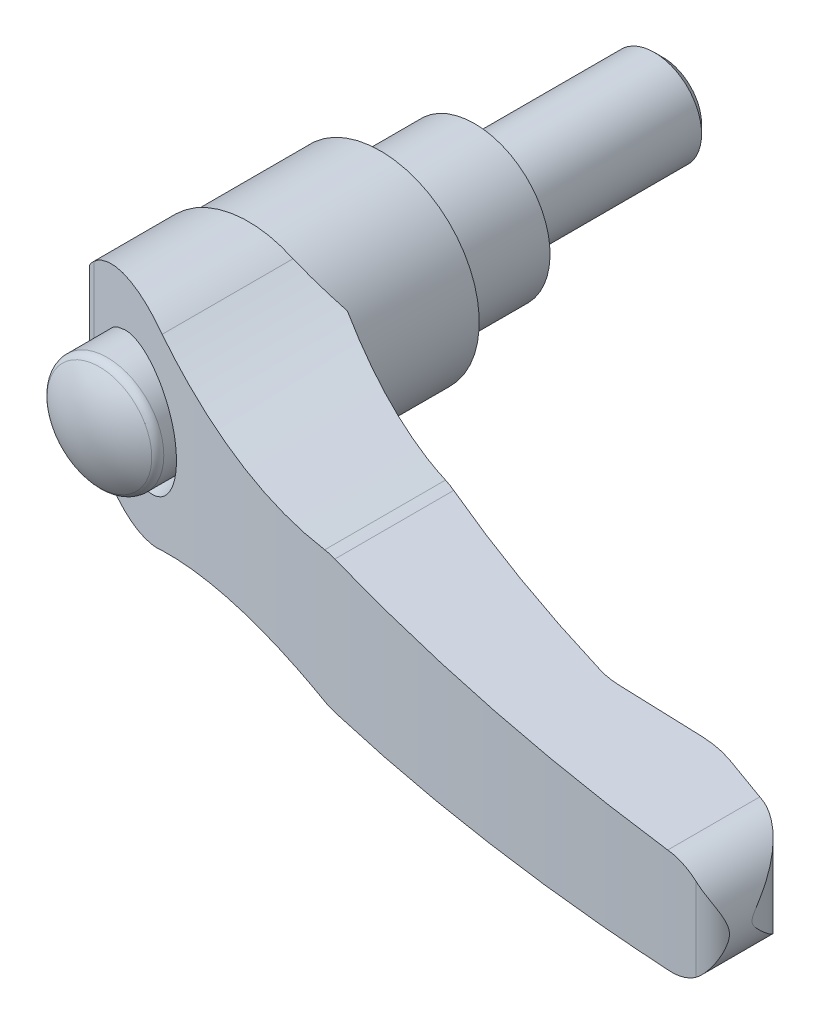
ISO-10303-21;
HEADER;
FILE_DESCRIPTION(('STEP AP214'),'2;1');
FILE_NAME('part.step','',(''),(''),'','','');
FILE_SCHEMA(('AUTOMOTIVE_DESIGN { 1 0 10303 214 1 1 1 1 }'));
ENDSEC;
DATA;
#1=APPLICATION_CONTEXT('core data for automotive mechanical design processes');
#2=APPLICATION_PROTOCOL_DEFINITION('international standard','automotive_design',2000,#1);
#3=PRODUCT_CONTEXT('',#1,'mechanical');
#4=PRODUCT('Part','Part','',(#3));
#5=PRODUCT_RELATED_PRODUCT_CATEGORY('part','',(#4));
#6=PRODUCT_DEFINITION_FORMATION('','',#4);
#7=PRODUCT_DEFINITION_CONTEXT('part definition',#1,'design');
#8=PRODUCT_DEFINITION('design','',#6,#7);
#9=PRODUCT_DEFINITION_SHAPE('','',#8);
#10=(LENGTH_UNIT() NAMED_UNIT(*) SI_UNIT(.MILLI.,.METRE.));
#11=(NAMED_UNIT(*) PLANE_ANGLE_UNIT() SI_UNIT($,.RADIAN.));
#12=(NAMED_UNIT(*) SI_UNIT($,.STERADIAN.) SOLID_ANGLE_UNIT());
#13=UNCERTAINTY_MEASURE_WITH_UNIT(LENGTH_MEASURE(1.E-05),#10,'distance_accuracy_value','');
#14=(GEOMETRIC_REPRESENTATION_CONTEXT(3) GLOBAL_UNCERTAINTY_ASSIGNED_CONTEXT((#13)) GLOBAL_UNIT_ASSIGNED_CONTEXT((#10,
#11,#12)) REPRESENTATION_CONTEXT('',''));
#15=CARTESIAN_POINT('',(0.,0.,0.));
#16=DIRECTION('',(0.,0.,1.));
#17=DIRECTION('',(1.,0.,0.));
#18=AXIS2_PLACEMENT_3D('',#15,#16,#17);
#19=CARTESIAN_POINT('',(2.04,0.,-20.));
#20=DIRECTION('',(0.,0.,-1.));
#21=DIRECTION('',(0.,1.,0.));
#22=AXIS2_PLACEMENT_3D('',#19,#20,#21);
#23=PLANE('',#22);
#24=CARTESIAN_POINT('',(0.,0.,-19.9999999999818));
#25=DIRECTION('',(0.,0.,1.));
#26=DIRECTION('',(0.,-1.,0.));
#27=AXIS2_PLACEMENT_3D('',#24,#25,#26);
#28=CIRCLE('',#27,4.07999999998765);
#29=CARTESIAN_POINT('',(0.,-4.07999999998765,-19.9999999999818));
#30=VERTEX_POINT('',#29);
#31=EDGE_CURVE('E17',#30,#30,#28,.T.);
#32=ORIENTED_EDGE('',*,*,#31,.F.);
#33=EDGE_LOOP('',(#32));
#34=FACE_BOUND('',#33,.T.);
#35=ADVANCED_FACE('F14',(#34),#23,.T.);
#36=CARTESIAN_POINT('',(0.,0.,-19.0800000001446));
#37=DIRECTION('',(0.,0.,1.));
#38=DIRECTION('',(0.,-1.,0.));
#39=AXIS2_PLACEMENT_3D('',#36,#37,#38);
#40=CONICAL_SURFACE('',#39,4.99999999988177,0.785398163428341);
#41=CARTESIAN_POINT('',(0.,0.,-19.08));
#42=DIRECTION('',(0.,0.,-1.));
#43=DIRECTION('',(0.,1.,0.));
#44=AXIS2_PLACEMENT_3D('',#41,#42,#43);
#45=CIRCLE('',#44,5.);
#46=CARTESIAN_POINT('',(0.,5.,-19.08));
#47=VERTEX_POINT('',#46);
#48=EDGE_CURVE('E189',#47,#47,#45,.F.);
#49=ORIENTED_EDGE('',*,*,#48,.F.);
#50=EDGE_LOOP('',(#49));
#51=FACE_BOUND('',#50,.T.);
#52=ORIENTED_EDGE('',*,*,#31,.T.);
#53=EDGE_LOOP('',(#52));
#54=FACE_BOUND('',#53,.T.);
#55=ADVANCED_FACE('F417',(#51,#54),#40,.T.);
#56=CARTESIAN_POINT('',(0.,0.,-9.54));
#57=DIRECTION('',(0.,0.,-1.));
#58=DIRECTION('',(0.,1.,0.));
#59=AXIS2_PLACEMENT_3D('',#56,#57,#58);
#60=CYLINDRICAL_SURFACE('',#59,5.);
#61=CARTESIAN_POINT('',(0.,0.,0.));
#62=DIRECTION('',(0.,0.,-1.));
#63=DIRECTION('',(0.,1.,0.));
#64=AXIS2_PLACEMENT_3D('',#61,#62,#63);
#65=CIRCLE('',#64,5.);
#66=CARTESIAN_POINT('',(0.,5.,0.));
#67=VERTEX_POINT('',#66);
#68=EDGE_CURVE('E191',#67,#67,#65,.F.);
#69=ORIENTED_EDGE('',*,*,#68,.F.);
#70=EDGE_LOOP('',(#69));
#71=FACE_BOUND('',#70,.T.);
#72=ORIENTED_EDGE('',*,*,#48,.T.);
#73=EDGE_LOOP('',(#72));
#74=FACE_BOUND('',#73,.T.);
#75=ADVANCED_FACE('F414',(#71,#74),#60,.T.);
#76=CARTESIAN_POINT('',(6.5,0.,0.));
#77=DIRECTION('',(0.,0.,-1.));
#78=DIRECTION('',(0.,1.,0.));
#79=AXIS2_PLACEMENT_3D('',#76,#77,#78);
#80=PLANE('',#79);
#81=ORIENTED_EDGE('',*,*,#68,.T.);
#82=EDGE_LOOP('',(#81));
#83=FACE_BOUND('',#82,.T.);
#84=CARTESIAN_POINT('',(0.,0.,0.));
#85=DIRECTION('',(0.,0.,-1.));
#86=DIRECTION('',(0.,1.,0.));
#87=AXIS2_PLACEMENT_3D('',#84,#85,#86);
#88=CIRCLE('',#87,8.);
#89=CARTESIAN_POINT('',(0.,8.,0.));
#90=VERTEX_POINT('',#89);
#91=EDGE_CURVE('E188',#90,#90,#88,.F.);
#92=ORIENTED_EDGE('',*,*,#91,.F.);
#93=EDGE_LOOP('',(#92));
#94=FACE_BOUND('',#93,.T.);
#95=ADVANCED_FACE('F410',(#83,#94),#80,.T.);
#96=CARTESIAN_POINT('',(0.,0.,11.15));
#97=DIRECTION('',(0.,0.,-1.));
#98=DIRECTION('',(0.,1.,0.));
#99=AXIS2_PLACEMENT_3D('',#96,#97,#98);
#100=CYLINDRICAL_SURFACE('',#99,8.);
#101=ORIENTED_EDGE('',*,*,#91,.T.);
#102=EDGE_LOOP('',(#101));
#103=FACE_BOUND('',#102,.T.);
#104=CARTESIAN_POINT('',(0.,0.,10.7));
#105=DIRECTION('',(0.,0.,-1.));
#106=DIRECTION('',(1.,0.,0.));
#107=AXIS2_PLACEMENT_3D('',#104,#105,#106);
#108=CIRCLE('',#107,8.);
#109=CARTESIAN_POINT('',(8.,0.,10.7));
#110=VERTEX_POINT('',#109);
#111=EDGE_CURVE('E185',#110,#110,#108,.T.);
#112=ORIENTED_EDGE('',*,*,#111,.T.);
#113=EDGE_LOOP('',(#112));
#114=FACE_BOUND('',#113,.T.);
#115=ADVANCED_FACE('F406',(#103,#114),#100,.T.);
#116=CARTESIAN_POINT('',(0.,0.,10.4));
#117=DIRECTION('',(0.,0.,-1.));
#118=DIRECTION('',(0.,1.,0.));
#119=AXIS2_PLACEMENT_3D('',#116,#117,#118);
#120=CONICAL_SURFACE('',#119,8.3,0.785398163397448);
#121=ORIENTED_EDGE('',*,*,#111,.F.);
#122=EDGE_LOOP('',(#121));
#123=FACE_BOUND('',#122,.T.);
#124=CARTESIAN_POINT('',(0.,0.,10.4));
#125=DIRECTION('',(0.,0.,-1.));
#126=DIRECTION('',(0.,1.,0.));
#127=AXIS2_PLACEMENT_3D('',#124,#125,#126);
#128=CIRCLE('',#127,8.3);
#129=CARTESIAN_POINT('',(0.,8.3,10.4));
#130=VERTEX_POINT('',#129);
#131=EDGE_CURVE('E177',#130,#130,#128,.T.);
#132=ORIENTED_EDGE('',*,*,#131,.T.);
#133=EDGE_LOOP('',(#132));
#134=FACE_BOUND('',#133,.T.);
#135=ADVANCED_FACE('F402',(#123,#134),#120,.F.);
#136=CARTESIAN_POINT('',(0.,0.,9.7));
#137=DIRECTION('',(0.,0.,-1.));
#138=DIRECTION('',(0.,1.,0.));
#139=AXIS2_PLACEMENT_3D('',#136,#137,#138);
#140=CYLINDRICAL_SURFACE('',#139,8.3);
#141=ORIENTED_EDGE('',*,*,#131,.F.);
#142=EDGE_LOOP('',(#141));
#143=FACE_BOUND('',#142,.T.);
#144=CARTESIAN_POINT('',(0.,0.,10.));
#145=DIRECTION('',(0.,0.,-1.));
#146=DIRECTION('',(0.,1.,0.));
#147=AXIS2_PLACEMENT_3D('',#144,#145,#146);
#148=CIRCLE('',#147,8.3);
#149=CARTESIAN_POINT('',(0.,8.3,10.));
#150=VERTEX_POINT('',#149);
#151=EDGE_CURVE('E174',#150,#150,#148,.F.);
#152=ORIENTED_EDGE('',*,*,#151,.F.);
#153=EDGE_LOOP('',(#152));
#154=FACE_BOUND('',#153,.T.);
#155=ADVANCED_FACE('F399',(#143,#154),#140,.F.);
#156=CARTESIAN_POINT('',(-5.26,0.,10.));
#157=DIRECTION('',(0.,0.,-1.));
#158=DIRECTION('',(0.,1.,0.));
#159=AXIS2_PLACEMENT_3D('',#156,#157,#158);
#160=PLANE('',#159);
#161=CARTESIAN_POINT('',(-0.00999999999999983,0.,10.));
#162=DIRECTION('',(0.,0.,1.));
#163=DIRECTION('',(-1.,0.,0.));
#164=AXIS2_PLACEMENT_3D('',#161,#162,#163);
#165=CIRCLE('',#164,10.5);
#166=CARTESIAN_POINT('',(-10.2600377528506,-2.27743848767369,10.));
#167=VERTEX_POINT('',#166);
#168=CARTESIAN_POINT('',(-10.2600377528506,2.27743848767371,10.));
#169=VERTEX_POINT('',#168);
#170=EDGE_CURVE('E166',#167,#169,#165,.T.);
#171=ORIENTED_EDGE('',*,*,#170,.F.);
#172=DIRECTION('',(0.,-1.,0.));
#173=VECTOR('',#172,1.);
#174=CARTESIAN_POINT('',(-10.2600377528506,-22.,10.));
#175=LINE('',#174,#173);
#176=EDGE_CURVE('E159',#167,#169,#175,.F.);
#177=ORIENTED_EDGE('',*,*,#176,.T.);
#178=EDGE_LOOP('',(#171,#177));
#179=FACE_BOUND('',#178,.T.);
#180=ORIENTED_EDGE('',*,*,#151,.T.);
#181=EDGE_LOOP('',(#180));
#182=FACE_BOUND('',#181,.T.);
#183=ADVANCED_FACE('F170',(#179,#182),#160,.T.);
#184=CARTESIAN_POINT('',(-10.2600377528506,-22.,10.));
#185=DIRECTION('',(0.707106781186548,0.,0.707106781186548));
#186=DIRECTION('',(-0.707106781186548,0.,0.707106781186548));
#187=AXIS2_PLACEMENT_3D('',#184,#185,#186);
#188=PLANE('',#187);
#189=ORIENTED_EDGE('',*,*,#176,.F.);
#190=CARTESIAN_POINT('',(-0.00999999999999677,0.,-0.250037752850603));
#191=DIRECTION('',(0.707106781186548,0.,0.707106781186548));
#192=DIRECTION('',(-0.707106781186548,0.,0.707106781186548));
#193=AXIS2_PLACEMENT_3D('',#190,#191,#192);
#194=ELLIPSE('',#193,14.8492424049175,10.5);
#195=EDGE_CURVE('E164',#169,#167,#194,.T.);
#196=ORIENTED_EDGE('',*,*,#195,.F.);
#197=EDGE_LOOP('',(#189,#196));
#198=FACE_BOUND('',#197,.T.);
#199=ADVANCED_FACE('F173',(#198),#188,.F.);
#200=CARTESIAN_POINT('',(-0.0100000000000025,0.,18.90625));
#201=DIRECTION('',(0.,0.,1.));
#202=DIRECTION('',(-1.,0.,0.));
#203=AXIS2_PLACEMENT_3D('',#200,#201,#202);
#204=CYLINDRICAL_SURFACE('',#203,10.5);
#205=CARTESIAN_POINT('',(-0.010000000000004,0.,24.));
#206=DIRECTION('',(0.,0.,1.));
#207=DIRECTION('',(-1.,0.,0.));
#208=AXIS2_PLACEMENT_3D('',#205,#206,#207);
#209=CIRCLE('',#208,10.5);
#210=CARTESIAN_POINT('',(-10.51,0.,24.));
#211=VERTEX_POINT('',#210);
#212=CARTESIAN_POINT('',(10.49,0.,24.));
#213=VERTEX_POINT('',#212);
#214=EDGE_CURVE('E168',#211,#213,#209,.T.);
#215=ORIENTED_EDGE('',*,*,#214,.F.);
#216=CARTESIAN_POINT('',(-0.010000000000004,0.,24.));
#217=DIRECTION('',(0.,0.,1.));
#218=DIRECTION('',(-1.,0.,0.));
#219=AXIS2_PLACEMENT_3D('',#216,#217,#218);
#220=CIRCLE('',#219,10.5);
#221=EDGE_CURVE('E362',#213,#211,#220,.T.);
#222=ORIENTED_EDGE('',*,*,#221,.F.);
#223=EDGE_LOOP('',(#215,#222));
#224=FACE_BOUND('',#223,.T.);
#225=ORIENTED_EDGE('',*,*,#170,.T.);
#226=ORIENTED_EDGE('',*,*,#195,.T.);
#227=EDGE_LOOP('',(#225,#226));
#228=FACE_BOUND('',#227,.T.);
#229=ADVANCED_FACE('F165',(#224,#228),#204,.T.);
#230=CARTESIAN_POINT('',(0.,0.,31.5));
#231=DIRECTION('',(1.,0.,0.));
#232=DIRECTION('',(0.,0.,1.));
#233=AXIS2_PLACEMENT_3D('',#230,#231,#232);
#234=SPHERICAL_SURFACE('',#233,10.);
#235=CARTESIAN_POINT('',(0.,0.,39.814794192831));
#236=DIRECTION('',(0.,0.,1.));
#237=DIRECTION('',(0.,-1.,0.));
#238=AXIS2_PLACEMENT_3D('',#235,#236,#237);
#239=CIRCLE('',#238,5.55555555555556);
#240=CARTESIAN_POINT('',(0.,-5.55555555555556,39.814794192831));
#241=VERTEX_POINT('',#240);
#242=EDGE_CURVE('E829',#241,#241,#239,.F.);
#243=ORIENTED_EDGE('',*,*,#242,.F.);
#244=EDGE_LOOP('',(#243));
#245=FACE_BOUND('',#244,.T.);
#246=ADVANCED_FACE('F387',(#245),#234,.T.);
#247=CARTESIAN_POINT('',(-10.51,-12.,24.));
#248=DIRECTION('',(0.,0.,-1.));
#249=DIRECTION('',(0.,1.,0.));
#250=AXIS2_PLACEMENT_3D('',#247,#248,#249);
#251=PLANE('',#250);
#252=ORIENTED_EDGE('',*,*,#214,.T.);
#253=DIRECTION('',(0.,-1.,0.));
#254=VECTOR('',#253,1.);
#255=CARTESIAN_POINT('',(10.4900000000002,-12.,23.9999999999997));
#256=LINE('',#255,#254);
#257=CARTESIAN_POINT('',(10.4900000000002,-8.03465812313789,24.));
#258=VERTEX_POINT('',#257);
#259=EDGE_CURVE('E369',#213,#258,#256,.T.);
#260=ORIENTED_EDGE('',*,*,#259,.T.);
#261=CARTESIAN_POINT('',(22.94,-55.53,24.));
#262=DIRECTION('',(0.,0.,1.));
#263=DIRECTION('',(0.,-1.,0.));
#264=AXIS2_PLACEMENT_3D('',#261,#262,#263);
#265=CIRCLE('',#264,49.1);
#266=CARTESIAN_POINT('',(4.72251026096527,-9.93468151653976,24.));
#267=VERTEX_POINT('',#266);
#268=EDGE_CURVE('E820',#258,#267,#265,.T.);
#269=ORIENTED_EDGE('',*,*,#268,.T.);
#270=CARTESIAN_POINT('',(0.,0.,24.));
#271=DIRECTION('',(0.,0.,1.));
#272=DIRECTION('',(0.,-1.,0.));
#273=AXIS2_PLACEMENT_3D('',#270,#271,#272);
#274=CIRCLE('',#273,11.);
#275=CARTESIAN_POINT('',(-10.51,-3.24652121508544,24.));
#276=VERTEX_POINT('',#275);
#277=EDGE_CURVE('E828',#276,#267,#274,.T.);
#278=ORIENTED_EDGE('',*,*,#277,.F.);
#279=DIRECTION('',(0.,-1.,0.));
#280=VECTOR('',#279,1.);
#281=CARTESIAN_POINT('',(-10.51,-12.,24.));
#282=LINE('',#281,#280);
#283=EDGE_CURVE('E835',#211,#276,#282,.T.);
#284=ORIENTED_EDGE('',*,*,#283,.F.);
#285=EDGE_LOOP('',(#252,#260,#269,#278,#284));
#286=FACE_BOUND('',#285,.T.);
#287=ADVANCED_FACE('F381',(#286),#251,.T.);
#288=CARTESIAN_POINT('',(31.3589689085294,0.945932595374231,54.5));
#289=DIRECTION('',(0.,0.,1.));
#290=DIRECTION('',(0.,-1.,0.));
#291=AXIS2_PLACEMENT_3D('',#288,#289,#290);
#292=CYLINDRICAL_SURFACE('',#291,8.00000000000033);
#293=CARTESIAN_POINT('',(31.6479325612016,-7.04884695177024,46.4731806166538));
#294=CARTESIAN_POINT('',(31.4018180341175,-7.05768532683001,46.4087993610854));
#295=CARTESIAN_POINT('',(31.1563854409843,-7.05525330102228,46.3442255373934));
#296=CARTESIAN_POINT('',(30.66688412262,-7.02784844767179,46.2146927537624));
#297=CARTESIAN_POINT('',(30.4228153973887,-7.00287562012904,46.1497337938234));
#298=CARTESIAN_POINT('',(30.1794286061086,-6.96663239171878,46.0845822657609));
#299=B_SPLINE_CURVE_WITH_KNOTS('',3,(#293,#294,#295,#296,#297,#298),.UNSPECIFIED.,.F.,.F.,(4,2,
4),(0.,0.76139061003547,1.52278122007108),.UNSPECIFIED.);
#300=CARTESIAN_POINT('',(31.6479325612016,-7.04884695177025,46.4731806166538));
#301=VERTEX_POINT('',#300);
#302=CARTESIAN_POINT('',(30.1794286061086,-6.96663239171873,46.084582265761));
#303=VERTEX_POINT('',#302);
#304=EDGE_CURVE('E215',#301,#303,#299,.T.);
#305=ORIENTED_EDGE('',*,*,#304,.T.);
#306=DIRECTION('',(0.,0.,1.));
#307=VECTOR('',#306,1.);
#308=CARTESIAN_POINT('',(30.1794286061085,-6.96663239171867,54.5));
#309=LINE('',#308,#307);
#310=CARTESIAN_POINT('',(30.1794286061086,-6.96663239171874,33.2732494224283));
#311=VERTEX_POINT('',#310);
#312=EDGE_CURVE('E815',#303,#311,#309,.F.);
#313=ORIENTED_EDGE('',*,*,#312,.T.);
#314=CARTESIAN_POINT('',(30.1794286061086,-6.9666323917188,33.2732494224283));
#315=CARTESIAN_POINT('',(30.4222007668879,-7.00282816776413,33.3728739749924));
#316=CARTESIAN_POINT('',(30.6665043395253,-7.02781937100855,33.4725985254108));
#317=CARTESIAN_POINT('',(31.0339219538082,-7.04840105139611,33.6217860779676));
#318=CARTESIAN_POINT('',(31.1565128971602,-7.05244559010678,33.6714318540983));
#319=CARTESIAN_POINT('',(31.4020580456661,-7.05489552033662,33.7706062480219));
#320=CARTESIAN_POINT('',(31.5250125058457,-7.05329063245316,33.8201344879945));
#321=CARTESIAN_POINT('',(31.6479325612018,-7.04884695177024,33.8695155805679));
#322=B_SPLINE_CURVE_WITH_KNOTS('',3,(#314,#315,#316,#317,#318,#319,#320,#321),.UNSPECIFIED.,.F.,
.F.,(4,2,2,4),(0.,0.794258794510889,1.19111760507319,1.58869889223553),.UNSPECIFIED.);
#323=CARTESIAN_POINT('',(31.6479325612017,-7.04884695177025,33.8695155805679));
#324=VERTEX_POINT('',#323);
#325=EDGE_CURVE('E364',#311,#324,#322,.T.);
#326=ORIENTED_EDGE('',*,*,#325,.T.);
#327=DIRECTION('',(0.,0.,1.));
#328=VECTOR('',#327,1.);
#329=CARTESIAN_POINT('',(31.6479325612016,-7.04884695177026,54.5));
#330=LINE('',#329,#328);
#331=EDGE_CURVE('E887',#324,#301,#330,.T.);
#332=ORIENTED_EDGE('',*,*,#331,.T.);
#333=EDGE_LOOP('',(#305,#313,#326,#332));
#334=FACE_BOUND('',#333,.T.);
#335=ADVANCED_FACE('F375',(#334),#292,.T.);
#336=CARTESIAN_POINT('',(79.9967051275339,-12.,50.5395921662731));
#337=DIRECTION('',(0.992331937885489,0.,-0.123601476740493));
#338=DIRECTION('',(0.123601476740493,0.,0.992331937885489));
#339=AXIS2_PLACEMENT_3D('',#336,#337,#338);
#340=PLANE('',#339);
#341=CARTESIAN_POINT('',(79.9967051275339,-0.190348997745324,50.5395921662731));
#342=CARTESIAN_POINT('',(79.996978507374,-0.182455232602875,50.5417865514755));
#343=CARTESIAN_POINT('',(79.9972360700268,-0.174525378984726,50.5438539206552));
#344=CARTESIAN_POINT('',(79.9977166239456,-0.15866415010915,50.5477110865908));
#345=CARTESIAN_POINT('',(79.9979398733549,-0.150733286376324,50.5495029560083));
#346=CARTESIAN_POINT('',(79.9983518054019,-0.134870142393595,50.5528091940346));
#347=CARTESIAN_POINT('',(79.9985407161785,-0.126938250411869,50.554325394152));
#348=CARTESIAN_POINT('',(79.9988840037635,-0.111073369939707,50.5570805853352));
#349=CARTESIAN_POINT('',(79.9990385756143,-0.103140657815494,50.5583211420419));
#350=CARTESIAN_POINT('',(79.9993132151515,-0.0872743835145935,50.5605253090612));
#351=CARTESIAN_POINT('',(79.9994334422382,-0.079341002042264,50.5614901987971));
#352=CARTESIAN_POINT('',(79.9996394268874,-0.0634736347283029,50.5631433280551));
#353=CARTESIAN_POINT('',(79.9997253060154,-0.0555397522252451,50.5638325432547));
#354=CARTESIAN_POINT('',(79.9998626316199,-0.0396716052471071,50.564934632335));
#355=CARTESIAN_POINT('',(79.9999141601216,-0.0317373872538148,50.5653481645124));
#356=CARTESIAN_POINT('',(79.9999828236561,-0.0158687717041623,50.5658992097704));
#357=CARTESIAN_POINT('',(80.,-0.00793438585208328,50.5660370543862));
#358=CARTESIAN_POINT('',(80.,0.00793438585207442,50.5660370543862));
#359=CARTESIAN_POINT('',(79.9999828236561,0.0158687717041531,50.5658992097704));
#360=CARTESIAN_POINT('',(79.9999141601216,0.0317373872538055,50.5653481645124));
#361=CARTESIAN_POINT('',(79.9998626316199,0.0396716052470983,50.564934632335));
#362=CARTESIAN_POINT('',(79.9997253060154,0.0555397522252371,50.5638325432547));
#363=CARTESIAN_POINT('',(79.9996394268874,0.0634736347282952,50.5631433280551));
#364=CARTESIAN_POINT('',(79.9994334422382,0.0793410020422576,50.5614901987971));
#365=CARTESIAN_POINT('',(79.9993132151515,0.0872743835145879,50.5605253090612));
#366=CARTESIAN_POINT('',(79.9990385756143,0.10314065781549,50.5583211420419));
#367=CARTESIAN_POINT('',(79.9988840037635,0.111073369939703,50.5570805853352));
#368=CARTESIAN_POINT('',(79.9985407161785,0.126938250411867,50.554325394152));
#369=CARTESIAN_POINT('',(79.9983518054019,0.134870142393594,50.5528091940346));
#370=CARTESIAN_POINT('',(79.9979398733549,0.150733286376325,50.5495029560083));
#371=CARTESIAN_POINT('',(79.9977166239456,0.158664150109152,50.5477110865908));
#372=CARTESIAN_POINT('',(79.9972360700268,0.17452537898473,50.5438539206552));
#373=CARTESIAN_POINT('',(79.996978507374,0.182455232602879,50.5417865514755));
#374=CARTESIAN_POINT('',(79.9967051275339,0.190348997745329,50.5395921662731));
#375=B_SPLINE_CURVE_WITH_KNOTS('',3,(#341,#342,#343,#344,#345,#346,#347,#348,#349,#350,#351,
#352,#353,#354,#355,#356,#357,#358,#359,#360,#361,#362,#363,#364,#365,#366,#367,#368,#369,#370,
#371,#372,#373,#374),.UNSPECIFIED.,.F.,.F.,(4,2,2,2,2,2,2,2,2,2,2,2,2,2,2,2,4),(0.,
0.0245922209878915,0.0489892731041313,0.0732177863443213,0.0973049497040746,0.121278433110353,
0.145166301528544,0.168996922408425,0.192798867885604,0.216600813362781,0.240431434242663,
0.264319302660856,0.288292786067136,0.312379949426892,0.336608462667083,0.361005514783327,
0.385597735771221),.UNSPECIFIED.);
#376=CARTESIAN_POINT('',(79.9967051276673,-0.190348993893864,50.5395921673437));
#377=VERTEX_POINT('',#376);
#378=CARTESIAN_POINT('',(79.9967051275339,0.190348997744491,50.5395921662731));
#379=VERTEX_POINT('',#378);
#380=EDGE_CURVE('E732',#377,#379,#375,.T.);
#381=ORIENTED_EDGE('',*,*,#380,.F.);
#382=DIRECTION('',(0.,-1.,0.));
#383=VECTOR('',#382,1.);
#384=CARTESIAN_POINT('',(79.9967051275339,-12.,50.5395921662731));
#385=LINE('',#384,#383);
#386=EDGE_CURVE('E781',#379,#377,#385,.T.);
#387=ORIENTED_EDGE('',*,*,#386,.F.);
#388=EDGE_LOOP('',(#381,#387));
#389=FACE_BOUND('',#388,.T.);
#390=ADVANCED_FACE('F380',(#389),#340,.T.);
#391=CARTESIAN_POINT('',(72.6137555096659,-12.,51.4591871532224));
#392=DIRECTION('',(0.,-1.,0.));
#393=DIRECTION('',(1.,0.,0.));
#394=AXIS2_PLACEMENT_3D('',#391,#392,#393);
#395=CYLINDRICAL_SURFACE('',#394,7.44);
#396=CARTESIAN_POINT('',(79.9967051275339,0.190348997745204,50.5395921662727));
#397=CARTESIAN_POINT('',(79.9951469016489,0.235214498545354,50.5270575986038));
#398=CARTESIAN_POINT('',(79.9930953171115,0.278736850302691,50.5108629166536));
#399=CARTESIAN_POINT('',(79.988164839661,0.363077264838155,50.4732708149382));
#400=CARTESIAN_POINT('',(79.9852922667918,0.403913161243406,50.4519133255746));
#401=CARTESIAN_POINT('',(79.975702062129,0.522458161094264,50.3833482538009));
#402=CARTESIAN_POINT('',(79.9679715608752,0.597169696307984,50.3312876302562));
#403=CARTESIAN_POINT('',(79.9508869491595,0.736456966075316,50.2251559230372));
#404=CARTESIAN_POINT('',(79.9416856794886,0.801375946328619,50.1714851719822));
#405=CARTESIAN_POINT('',(79.9214540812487,0.928420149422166,50.0612288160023));
#406=CARTESIAN_POINT('',(79.9104232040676,0.990544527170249,50.0046423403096));
#407=CARTESIAN_POINT('',(79.8746515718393,1.17419942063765,49.8323129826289));
#408=CARTESIAN_POINT('',(79.8472488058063,1.29287988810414,49.7141099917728));
#409=CARTESIAN_POINT('',(79.7848398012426,1.52823594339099,49.4729704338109));
#410=CARTESIAN_POINT('',(79.7496926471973,1.64482416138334,49.3499864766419));
#411=CARTESIAN_POINT('',(79.6721004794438,1.87458318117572,49.1033284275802));
#412=CARTESIAN_POINT('',(79.6296610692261,1.98775652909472,48.9796549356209));
#413=CARTESIAN_POINT('',(79.5033816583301,2.29352791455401,48.6415502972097));
#414=CARTESIAN_POINT('',(79.4120558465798,2.48329449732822,48.427296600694));
#415=CARTESIAN_POINT('',(79.2061355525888,2.85434488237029,48.0023120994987));
#416=CARTESIAN_POINT('',(79.0915236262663,3.03562219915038,47.7915840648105));
#417=CARTESIAN_POINT('',(78.8390032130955,3.38665877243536,47.3777391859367));
#418=CARTESIAN_POINT('',(78.7012752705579,3.55649399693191,47.1745772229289));
#419=CARTESIAN_POINT('',(78.4009143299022,3.8835680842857,46.7768350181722));
#420=CARTESIAN_POINT('',(78.2383021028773,4.04081728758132,46.5822477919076));
#421=CARTESIAN_POINT('',(77.9568022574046,4.2801698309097,46.2794503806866));
#422=CARTESIAN_POINT('',(77.8461272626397,4.36735584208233,46.1675710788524));
#423=CARTESIAN_POINT('',(77.61512986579,4.53501217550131,45.9487274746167));
#424=CARTESIAN_POINT('',(77.494805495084,4.61548112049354,45.8417641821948));
#425=CARTESIAN_POINT('',(77.2447591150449,4.7684092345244,45.6339165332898));
#426=CARTESIAN_POINT('',(77.1150589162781,4.84088606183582,45.5330190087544));
#427=CARTESIAN_POINT('',(76.8461728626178,4.97676025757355,45.3380932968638));
#428=CARTESIAN_POINT('',(76.7069926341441,5.04016294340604,45.2440611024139));
#429=CARTESIAN_POINT('',(76.4438690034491,5.14664435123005,45.0792448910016));
#430=CARTESIAN_POINT('',(76.3213555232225,5.19134589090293,45.0072256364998));
#431=CARTESIAN_POINT('',(76.0703754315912,5.27269544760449,44.8693561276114));
#432=CARTESIAN_POINT('',(75.9419112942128,5.30934677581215,44.8035033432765));
#433=CARTESIAN_POINT('',(75.678496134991,5.37397975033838,44.6781572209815));
#434=CARTESIAN_POINT('',(75.5435027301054,5.40189236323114,44.6187168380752));
#435=CARTESIAN_POINT('',(75.2686009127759,5.44782102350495,44.507386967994));
#436=CARTESIAN_POINT('',(75.1286862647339,5.46582399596,44.4555075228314));
#437=CARTESIAN_POINT('',(74.9868127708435,5.47841339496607,44.407790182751));
#438=B_SPLINE_CURVE_WITH_KNOTS('',3,(#396,#397,#398,#399,#400,#401,#402,#403,#404,#405,#406,
#407,#408,#409,#410,#411,#412,#413,#414,#415,#416,#417,#418,#419,#420,#421,#422,#423,#424,#425,
#426,#427,#428,#429,#430,#431,#432,#433,#434,#435,#436,#437),.UNSPECIFIED.,.F.,.F.,(4,2,2,2,2,2,
2,2,2,2,2,2,2,2,2,2,2,2,2,2,4),(0.,0.139245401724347,0.277446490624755,0.550810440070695,
0.80490688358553,1.05907965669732,1.56794086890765,2.08696422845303,2.60559053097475,
3.50582150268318,4.40672935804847,5.30090298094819,6.1943342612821,6.7336794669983,
7.27313498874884,7.81137365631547,8.3492956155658,8.79580649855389,9.2421333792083,
9.69190199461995,10.1422626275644),.UNSPECIFIED.);
#439=CARTESIAN_POINT('',(74.9868127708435,5.47841339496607,44.407790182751));
#440=VERTEX_POINT('',#439);
#441=EDGE_CURVE('E736',#379,#440,#438,.T.);
#442=ORIENTED_EDGE('',*,*,#441,.F.);
#443=ORIENTED_EDGE('',*,*,#386,.T.);
#444=CARTESIAN_POINT('',(74.9868127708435,-5.47841339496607,44.407790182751));
#445=CARTESIAN_POINT('',(75.1398120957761,-5.46484028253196,44.459242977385));
#446=CARTESIAN_POINT('',(75.2905169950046,-5.44496899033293,44.5155387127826));
#447=CARTESIAN_POINT('',(75.5860882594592,-5.39377415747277,44.6368581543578));
#448=CARTESIAN_POINT('',(75.7309637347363,-5.36246932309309,44.7018674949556));
#449=CARTESIAN_POINT('',(76.0125967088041,-5.28989557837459,44.8390817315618));
#450=CARTESIAN_POINT('',(76.1494251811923,-5.24873835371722,44.9112009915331));
#451=CARTESIAN_POINT('',(76.4161065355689,-5.15736483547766,45.0623731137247));
#452=CARTESIAN_POINT('',(76.5459558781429,-5.10714400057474,45.1414294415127));
#453=CARTESIAN_POINT('',(76.8276536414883,-4.98604991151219,45.3247681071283));
#454=CARTESIAN_POINT('',(76.9775772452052,-4.91309116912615,45.4306358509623));
#455=CARTESIAN_POINT('',(77.265789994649,-4.75681575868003,45.6501400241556));
#456=CARTESIAN_POINT('',(77.4040776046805,-4.67349772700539,45.7637774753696));
#457=CARTESIAN_POINT('',(77.8028296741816,-4.40945601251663,46.1156758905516));
#458=CARTESIAN_POINT('',(78.0457801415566,-4.21527563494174,46.3639882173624));
#459=CARTESIAN_POINT('',(78.417694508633,-3.86589184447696,46.7984433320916));
#460=CARTESIAN_POINT('',(78.5586476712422,-3.71726415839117,46.9799982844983));
#461=CARTESIAN_POINT('',(78.8199419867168,-3.41009407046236,47.3496806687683));
#462=CARTESIAN_POINT('',(78.940273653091,-3.25154715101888,47.537811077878));
#463=CARTESIAN_POINT('',(79.1607378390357,-2.92676895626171,47.9181651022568));
#464=CARTESIAN_POINT('',(79.2609186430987,-2.76055725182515,48.1103776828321));
#465=CARTESIAN_POINT('',(79.4421677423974,-2.42115236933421,48.4974286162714));
#466=CARTESIAN_POINT('',(79.5232445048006,-2.24796232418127,48.692265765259));
#467=CARTESIAN_POINT('',(79.6578968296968,-1.91676087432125,49.0578102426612));
#468=CARTESIAN_POINT('',(79.7136489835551,-1.75958096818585,49.2284695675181));
#469=CARTESIAN_POINT('',(79.786963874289,-1.51825146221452,49.4826945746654));
#470=CARTESIAN_POINT('',(79.8097141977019,-1.43673320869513,49.567289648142));
#471=CARTESIAN_POINT('',(79.8517302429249,-1.27132927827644,49.7350141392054));
#472=CARTESIAN_POINT('',(79.870996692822,-1.18744410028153,49.8181438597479));
#473=CARTESIAN_POINT('',(79.9071865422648,-1.01046435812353,49.9869732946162));
#474=CARTESIAN_POINT('',(79.9238666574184,-0.917129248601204,50.0724723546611));
#475=CARTESIAN_POINT('',(79.9529450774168,-0.724505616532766,50.2358460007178));
#476=CARTESIAN_POINT('',(79.9653823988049,-0.625281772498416,50.3137850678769));
#477=CARTESIAN_POINT('',(79.9802376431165,-0.468580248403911,50.4153149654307));
#478=CARTESIAN_POINT('',(79.9845030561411,-0.416215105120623,50.4460963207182));
#479=CARTESIAN_POINT('',(79.9917045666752,-0.30687937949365,50.4998809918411));
#480=CARTESIAN_POINT('',(79.9946243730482,-0.249861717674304,50.5227881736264));
#481=CARTESIAN_POINT('',(79.9967051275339,-0.190348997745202,50.5395921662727));
#482=B_SPLINE_CURVE_WITH_KNOTS('',3,(#444,#445,#446,#447,#448,#449,#450,#451,#452,#453,#454,
#455,#456,#457,#458,#459,#460,#461,#462,#463,#464,#465,#466,#467,#468,#469,#470,#471,#472,#473,
#474,#475,#476,#477,#478,#479,#480,#481),.UNSPECIFIED.,.F.,.F.,(4,2,2,2,2,2,2,2,2,2,2,2,2,2,2,2,
2,2,4),(0.,0.485611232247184,0.970431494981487,1.44999646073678,1.92980238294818,
2.52141817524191,3.11311192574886,4.30183389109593,5.12208341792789,5.94270927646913,
6.76134473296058,7.57961667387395,8.29494630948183,8.65387747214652,9.01273353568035,
9.39561932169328,9.77488268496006,9.95698827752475,10.141244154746),.UNSPECIFIED.);
#483=CARTESIAN_POINT('',(74.9868127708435,-5.47841339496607,44.407790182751));
#484=VERTEX_POINT('',#483);
#485=EDGE_CURVE('E737',#484,#377,#482,.T.);
#486=ORIENTED_EDGE('',*,*,#485,.F.);
#487=DIRECTION('',(0.,-1.,0.));
#488=VECTOR('',#487,1.);
#489=CARTESIAN_POINT('',(74.9868127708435,-12.,44.407790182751));
#490=LINE('',#489,#488);
#491=EDGE_CURVE('E782',#440,#484,#490,.T.);
#492=ORIENTED_EDGE('',*,*,#491,.F.);
#493=EDGE_LOOP('',(#442,#443,#486,#492));
#494=FACE_BOUND('',#493,.T.);
#495=ADVANCED_FACE('F520',(#494),#395,.T.);
#496=CARTESIAN_POINT('',(57.3760512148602,-12.,33.47));
#497=DIRECTION('',(0.,-1.,0.));
#498=DIRECTION('',(1.,0.,0.));
#499=AXIS2_PLACEMENT_3D('',#496,#497,#498);
#500=CYLINDRICAL_SURFACE('',#499,8.58999999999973);
#501=DIRECTION('',(0.,-1.,0.));
#502=VECTOR('',#501,1.);
#503=CARTESIAN_POINT('',(55.1138126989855,-12.,41.756759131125));
#504=LINE('',#503,#502);
#505=CARTESIAN_POINT('',(55.1138126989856,-6.20069518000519,41.7567591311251));
#506=VERTEX_POINT('',#505);
#507=CARTESIAN_POINT('',(55.1138126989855,6.2006951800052,41.7567591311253));
#508=VERTEX_POINT('',#507);
#509=EDGE_CURVE('E361',#506,#508,#504,.F.);
#510=ORIENTED_EDGE('',*,*,#509,.T.);
#511=CARTESIAN_POINT('',(57.3760512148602,6.11892873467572,33.47));
#512=DIRECTION('',(-0.0361204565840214,-0.999347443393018,0.));
#513=DIRECTION('',(0.999347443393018,-0.0361204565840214,0.));
#514=AXIS2_PLACEMENT_3D('',#511,#512,#513);
#515=ELLIPSE('',#514,8.59560912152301,8.58999999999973);
#516=CARTESIAN_POINT('',(57.3760512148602,6.11892873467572,42.06));
#517=VERTEX_POINT('',#516);
#518=EDGE_CURVE('E725',#508,#517,#515,.F.);
#519=ORIENTED_EDGE('',*,*,#518,.T.);
#520=DIRECTION('',(0.,1.,0.));
#521=VECTOR('',#520,1.);
#522=CARTESIAN_POINT('',(57.3760512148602,-12.,42.06));
#523=LINE('',#522,#521);
#524=CARTESIAN_POINT('',(57.3760512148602,-6.11892873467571,42.06));
#525=VERTEX_POINT('',#524);
#526=EDGE_CURVE('E844',#525,#517,#523,.T.);
#527=ORIENTED_EDGE('',*,*,#526,.F.);
#528=CARTESIAN_POINT('',(57.3760512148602,-6.11892873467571,33.47));
#529=DIRECTION('',(-0.0361204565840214,0.999347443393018,0.));
#530=DIRECTION('',(-0.999347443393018,-0.0361204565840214,0.));
#531=AXIS2_PLACEMENT_3D('',#528,#529,#530);
#532=ELLIPSE('',#531,8.59560912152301,8.58999999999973);
#533=EDGE_CURVE('E898',#525,#506,#532,.F.);
#534=ORIENTED_EDGE('',*,*,#533,.T.);
#535=EDGE_LOOP('',(#510,#519,#527,#534));
#536=FACE_BOUND('',#535,.T.);
#537=ADVANCED_FACE('F529',(#536),#500,.F.);
#538=CARTESIAN_POINT('',(57.3760512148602,-12.,42.06));
#539=DIRECTION('',(0.,0.,-1.));
#540=DIRECTION('',(0.,1.,0.));
#541=AXIS2_PLACEMENT_3D('',#538,#539,#540);
#542=PLANE('',#541);
#543=DIRECTION('',(0.999347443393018,-0.0361204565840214,0.));
#544=VECTOR('',#543,1.);
#545=CARTESIAN_POINT('',(31.6479325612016,7.04884695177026,42.06));
#546=LINE('',#545,#544);
#547=CARTESIAN_POINT('',(66.1633245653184,5.80132115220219,42.06));
#548=VERTEX_POINT('',#547);
#549=EDGE_CURVE('E723',#517,#548,#546,.T.);
#550=ORIENTED_EDGE('',*,*,#549,.T.);
#551=DIRECTION('',(0.,-1.,0.));
#552=VECTOR('',#551,1.);
#553=CARTESIAN_POINT('',(66.1633245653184,-12.,42.06));
#554=LINE('',#553,#552);
#555=CARTESIAN_POINT('',(66.1633245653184,-5.80132115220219,42.06));
#556=VERTEX_POINT('',#555);
#557=EDGE_CURVE('E841',#556,#548,#554,.F.);
#558=ORIENTED_EDGE('',*,*,#557,.F.);
#559=DIRECTION('',(-0.999347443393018,-0.0361204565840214,0.));
#560=VECTOR('',#559,1.);
#561=CARTESIAN_POINT('',(74.5,-5.5,42.06));
#562=LINE('',#561,#560);
#563=EDGE_CURVE('E823',#556,#525,#562,.T.);
#564=ORIENTED_EDGE('',*,*,#563,.T.);
#565=ORIENTED_EDGE('',*,*,#526,.T.);
#566=EDGE_LOOP('',(#550,#558,#564,#565));
#567=FACE_BOUND('',#566,.T.);
#568=ADVANCED_FACE('F538',(#567),#542,.T.);
#569=CARTESIAN_POINT('',(66.1633245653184,-12.,53.34));
#570=DIRECTION('',(0.,-1.,0.));
#571=DIRECTION('',(1.,0.,0.));
#572=AXIS2_PLACEMENT_3D('',#569,#570,#571);
#573=CYLINDRICAL_SURFACE('',#572,11.2800000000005);
#574=CARTESIAN_POINT('',(66.1633245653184,5.80132115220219,53.34));
#575=DIRECTION('',(-0.0361204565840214,-0.999347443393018,0.));
#576=DIRECTION('',(0.999347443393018,-0.0361204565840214,0.));
#577=AXIS2_PLACEMENT_3D('',#574,#575,#576);
#578=ELLIPSE('',#577,11.2873656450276,11.2800000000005);
#579=CARTESIAN_POINT('',(69.7611855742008,5.6712799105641,42.6491723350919));
#580=VERTEX_POINT('',#579);
#581=EDGE_CURVE('E722',#548,#580,#578,.T.);
#582=ORIENTED_EDGE('',*,*,#581,.T.);
#583=DIRECTION('',(0.,-1.,0.));
#584=VECTOR('',#583,1.);
#585=CARTESIAN_POINT('',(69.7611855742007,-12.,42.6491723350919));
#586=LINE('',#585,#584);
#587=CARTESIAN_POINT('',(69.7611855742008,-5.6712799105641,42.6491723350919));
#588=VERTEX_POINT('',#587);
#589=EDGE_CURVE('E784',#588,#580,#586,.F.);
#590=ORIENTED_EDGE('',*,*,#589,.F.);
#591=CARTESIAN_POINT('',(66.1633245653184,-5.80132115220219,53.34));
#592=DIRECTION('',(-0.0361204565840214,0.999347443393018,0.));
#593=DIRECTION('',(-0.999347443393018,-0.0361204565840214,0.));
#594=AXIS2_PLACEMENT_3D('',#591,#592,#593);
#595=ELLIPSE('',#594,11.2873656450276,11.2800000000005);
#596=EDGE_CURVE('E819',#588,#556,#595,.T.);
#597=ORIENTED_EDGE('',*,*,#596,.T.);
#598=ORIENTED_EDGE('',*,*,#557,.T.);
#599=EDGE_LOOP('',(#582,#590,#597,#598));
#600=FACE_BOUND('',#599,.T.);
#601=ADVANCED_FACE('F548',(#600),#573,.T.);
#602=CARTESIAN_POINT('',(69.7611855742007,-12.,42.6491723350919));
#603=DIRECTION('',(0.318959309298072,0.,-0.947768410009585));
#604=DIRECTION('',(0.947768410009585,0.,0.318959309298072));
#605=AXIS2_PLACEMENT_3D('',#602,#603,#604);
#606=PLANE('',#605);
#607=ORIENTED_EDGE('',*,*,#491,.T.);
#608=CARTESIAN_POINT('',(74.5,0.,44.2439595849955));
#609=DIRECTION('',(0.318959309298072,0.,-0.947768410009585));
#610=DIRECTION('',(0.947768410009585,0.,0.318959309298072));
#611=AXIS2_PLACEMENT_3D('',#608,#609,#610);
#612=ELLIPSE('',#611,5.80310542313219,5.5);
#613=CARTESIAN_POINT('',(74.5,-5.5,44.2439595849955));
#614=VERTEX_POINT('',#613);
#615=EDGE_CURVE('E895',#614,#484,#612,.F.);
#616=ORIENTED_EDGE('',*,*,#615,.F.);
#617=DIRECTION('',(-0.947212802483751,-0.0342360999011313,-0.318772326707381));
#618=VECTOR('',#617,1.);
#619=CARTESIAN_POINT('',(74.5,-5.5,44.2439595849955));
#620=LINE('',#619,#618);
#621=EDGE_CURVE('E890',#614,#588,#620,.T.);
#622=ORIENTED_EDGE('',*,*,#621,.T.);
#623=ORIENTED_EDGE('',*,*,#589,.T.);
#624=DIRECTION('',(0.947212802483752,-0.0342360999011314,0.31877232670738));
#625=VECTOR('',#624,1.);
#626=CARTESIAN_POINT('',(69.7611855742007,5.6712799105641,42.6491723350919));
#627=LINE('',#626,#625);
#628=CARTESIAN_POINT('',(74.5,5.5,44.2439595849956));
#629=VERTEX_POINT('',#628);
#630=EDGE_CURVE('E719',#580,#629,#627,.T.);
#631=ORIENTED_EDGE('',*,*,#630,.T.);
#632=CARTESIAN_POINT('',(74.5,0.,44.2439595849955));
#633=DIRECTION('',(0.318959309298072,0.,-0.947768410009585));
#634=DIRECTION('',(0.947768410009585,0.,0.318959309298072));
#635=AXIS2_PLACEMENT_3D('',#632,#633,#634);
#636=ELLIPSE('',#635,5.80310542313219,5.5);
#637=EDGE_CURVE('E766',#440,#629,#636,.F.);
#638=ORIENTED_EDGE('',*,*,#637,.F.);
#639=EDGE_LOOP('',(#607,#616,#622,#623,#631,#638));
#640=FACE_BOUND('',#639,.T.);
#641=ADVANCED_FACE('F558',(#640),#606,.T.);
#642=CARTESIAN_POINT('',(31.3589689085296,-0.945932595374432,54.5));
#643=DIRECTION('',(0.,0.,1.));
#644=DIRECTION('',(0.,-1.,0.));
#645=AXIS2_PLACEMENT_3D('',#642,#643,#644);
#646=CYLINDRICAL_SURFACE('',#645,8.00000000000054);
#647=CARTESIAN_POINT('',(30.1794286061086,6.96663239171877,46.0845822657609));
#648=CARTESIAN_POINT('',(30.4228153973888,7.00287562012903,46.1497337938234));
#649=CARTESIAN_POINT('',(30.66688412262,7.02784844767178,46.2146927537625));
#650=CARTESIAN_POINT('',(31.1563854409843,7.05525330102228,46.3442255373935));
#651=CARTESIAN_POINT('',(31.4018180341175,7.05768532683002,46.4087993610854));
#652=CARTESIAN_POINT('',(31.6479325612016,7.04884695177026,46.4731806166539));
#653=B_SPLINE_CURVE_WITH_KNOTS('',3,(#647,#648,#649,#650,#651,#652),.UNSPECIFIED.,.F.,.F.,(4,2,
4),(0.,0.761390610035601,1.52278122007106),.UNSPECIFIED.);
#654=CARTESIAN_POINT('',(30.1794286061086,6.96663239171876,46.0845822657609));
#655=VERTEX_POINT('',#654);
#656=CARTESIAN_POINT('',(31.6479325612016,7.04884695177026,46.4731806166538));
#657=VERTEX_POINT('',#656);
#658=EDGE_CURVE('E370',#655,#657,#653,.T.);
#659=ORIENTED_EDGE('',*,*,#658,.T.);
#660=DIRECTION('',(0.,0.,1.));
#661=VECTOR('',#660,1.);
#662=CARTESIAN_POINT('',(31.6479325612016,7.04884695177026,54.5));
#663=LINE('',#662,#661);
#664=CARTESIAN_POINT('',(31.6479325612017,7.04884695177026,33.8695155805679));
#665=VERTEX_POINT('',#664);
#666=EDGE_CURVE('E726',#657,#665,#663,.F.);
#667=ORIENTED_EDGE('',*,*,#666,.T.);
#668=CARTESIAN_POINT('',(31.6479325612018,7.04884695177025,33.8695155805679));
#669=CARTESIAN_POINT('',(31.5250125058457,7.05329063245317,33.8201344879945));
#670=CARTESIAN_POINT('',(31.4020580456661,7.05489552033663,33.7706062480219));
#671=CARTESIAN_POINT('',(31.1565128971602,7.05244559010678,33.6714318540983));
#672=CARTESIAN_POINT('',(31.0339219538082,7.04840105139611,33.6217860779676));
#673=CARTESIAN_POINT('',(30.6665043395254,7.02781937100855,33.4725985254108));
#674=CARTESIAN_POINT('',(30.4222007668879,7.00282816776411,33.3728739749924));
#675=CARTESIAN_POINT('',(30.1794286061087,6.96663239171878,33.2732494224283));
#676=B_SPLINE_CURVE_WITH_KNOTS('',3,(#668,#669,#670,#671,#672,#673,#674,#675),.UNSPECIFIED.,.F.,
.F.,(4,2,2,4),(0.,0.39758128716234,0.794440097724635,1.58869889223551),.UNSPECIFIED.);
#677=CARTESIAN_POINT('',(30.1794286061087,6.96663239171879,33.2732494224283));
#678=VERTEX_POINT('',#677);
#679=EDGE_CURVE('E354',#665,#678,#676,.T.);
#680=ORIENTED_EDGE('',*,*,#679,.T.);
#681=DIRECTION('',(0.,0.,1.));
#682=VECTOR('',#681,1.);
#683=CARTESIAN_POINT('',(30.1794286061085,6.96663239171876,54.5));
#684=LINE('',#683,#682);
#685=EDGE_CURVE('E716',#678,#655,#684,.T.);
#686=ORIENTED_EDGE('',*,*,#685,.T.);
#687=EDGE_LOOP('',(#659,#667,#680,#686));
#688=FACE_BOUND('',#687,.T.);
#689=ADVANCED_FACE('F337',(#688),#646,.T.);
#690=CARTESIAN_POINT('',(111.590768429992,-12.,-165.122809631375));
#691=DIRECTION('',(0.,-1.,0.));
#692=DIRECTION('',(1.,0.,0.));
#693=AXIS2_PLACEMENT_3D('',#690,#691,#692);
#694=CYLINDRICAL_SURFACE('',#693,214.45);
#695=ORIENTED_EDGE('',*,*,#679,.F.);
#696=CARTESIAN_POINT('',(111.590768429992,4.15938968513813,-165.122809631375));
#697=DIRECTION('',(-0.0361204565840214,-0.999347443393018,0.));
#698=DIRECTION('',(0.999347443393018,-0.0361204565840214,0.));
#699=AXIS2_PLACEMENT_3D('',#696,#697,#698);
#700=ELLIPSE('',#699,214.590032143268,214.45);
#701=EDGE_CURVE('E728',#665,#508,#700,.F.);
#702=ORIENTED_EDGE('',*,*,#701,.T.);
#703=ORIENTED_EDGE('',*,*,#509,.F.);
#704=CARTESIAN_POINT('',(111.590768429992,-4.15938968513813,-165.122809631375));
#705=DIRECTION('',(-0.0361204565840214,0.999347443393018,0.));
#706=DIRECTION('',(-0.999347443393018,-0.0361204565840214,0.));
#707=AXIS2_PLACEMENT_3D('',#704,#705,#706);
#708=ELLIPSE('',#707,214.590032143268,214.45);
#709=EDGE_CURVE('E891',#506,#324,#708,.F.);
#710=ORIENTED_EDGE('',*,*,#709,.T.);
#711=ORIENTED_EDGE('',*,*,#325,.F.);
#712=CARTESIAN_POINT('',(30.1794286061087,-6.9666323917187,33.2732494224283));
#713=CARTESIAN_POINT('',(29.3385114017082,-6.84126069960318,32.9282027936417));
#714=CARTESIAN_POINT('',(28.4970001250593,-6.73815583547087,32.5766232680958));
#715=CARTESIAN_POINT('',(26.8150445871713,-6.57586454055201,31.8612301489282));
#716=CARTESIAN_POINT('',(25.9746002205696,-6.51667337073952,31.4974178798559));
#717=CARTESIAN_POINT('',(24.3042391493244,-6.44189817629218,30.7615707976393));
#718=CARTESIAN_POINT('',(23.4742949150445,-6.42593469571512,30.3896366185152));
#719=CARTESIAN_POINT('',(21.8194069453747,-6.43581555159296,29.6353273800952));
#720=CARTESIAN_POINT('',(20.994463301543,-6.46166065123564,29.2529521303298));
#721=CARTESIAN_POINT('',(19.3515465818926,-6.55439535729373,28.4787218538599));
#722=CARTESIAN_POINT('',(18.5335723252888,-6.62127786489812,28.0868684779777));
#723=CARTESIAN_POINT('',(16.9061160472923,-6.79528972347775,27.2945449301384));
#724=CARTESIAN_POINT('',(16.0966341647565,-6.90241973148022,26.8940746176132));
#725=CARTESIAN_POINT('',(14.4805646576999,-7.15724867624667,26.0818856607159));
#726=CARTESIAN_POINT('',(13.6740672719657,-7.305300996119,25.6700985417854));
#727=CARTESIAN_POINT('',(12.0728488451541,-7.64070973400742,24.8398212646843));
#728=CARTESIAN_POINT('',(11.2781269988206,-7.82806345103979,24.4213315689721));
#729=CARTESIAN_POINT('',(10.4900000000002,-8.03465812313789,23.9999999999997));
#730=B_SPLINE_CURVE_WITH_KNOTS('',3,(#712,#713,#714,#715,#716,#717,#718,#719,#720,#721,#722,
#723,#724,#725,#726,#727,#728,#729),.UNSPECIFIED.,.F.,.F.,(4,2,2,2,2,2,2,2,4),(0.,
2.75232880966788,5.50436055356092,8.23215522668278,10.9599996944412,13.6873724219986,
16.4147896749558,19.1665377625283,21.9180967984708),.UNSPECIFIED.);
#731=EDGE_CURVE('E344',#311,#258,#730,.T.);
#732=ORIENTED_EDGE('',*,*,#731,.T.);
#733=ORIENTED_EDGE('',*,*,#259,.F.);
#734=DIRECTION('',(0.,1.,0.));
#735=VECTOR('',#734,1.);
#736=CARTESIAN_POINT('',(10.49,-12.,24.));
#737=LINE('',#736,#735);
#738=CARTESIAN_POINT('',(10.49,8.03465812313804,24.));
#739=VERTEX_POINT('',#738);
#740=EDGE_CURVE('E360',#739,#213,#737,.F.);
#741=ORIENTED_EDGE('',*,*,#740,.F.);
#742=CARTESIAN_POINT('',(10.4900000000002,8.03465812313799,23.9999999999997));
#743=CARTESIAN_POINT('',(11.2781269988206,7.82806345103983,24.4213315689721));
#744=CARTESIAN_POINT('',(12.0728488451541,7.64070973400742,24.8398212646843));
#745=CARTESIAN_POINT('',(13.6740672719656,7.30530099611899,25.6700985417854));
#746=CARTESIAN_POINT('',(14.4805646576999,7.15724867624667,26.0818856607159));
#747=CARTESIAN_POINT('',(16.0966341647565,6.90241973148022,26.8940746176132));
#748=CARTESIAN_POINT('',(16.9061160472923,6.79528972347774,27.2945449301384));
#749=CARTESIAN_POINT('',(18.5335723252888,6.62127786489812,28.0868684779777));
#750=CARTESIAN_POINT('',(19.3515465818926,6.55439535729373,28.4787218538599));
#751=CARTESIAN_POINT('',(20.994463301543,6.46166065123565,29.2529521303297));
#752=CARTESIAN_POINT('',(21.8194069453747,6.43581555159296,29.6353273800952));
#753=CARTESIAN_POINT('',(23.4742949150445,6.42593469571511,30.3896366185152));
#754=CARTESIAN_POINT('',(24.3042391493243,6.44189817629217,30.7615707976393));
#755=CARTESIAN_POINT('',(25.9746002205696,6.51667337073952,31.4974178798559));
#756=CARTESIAN_POINT('',(26.8150445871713,6.575864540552,31.8612301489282));
#757=CARTESIAN_POINT('',(28.4970001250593,6.73815583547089,32.5766232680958));
#758=CARTESIAN_POINT('',(29.3385114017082,6.84126069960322,32.9282027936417));
#759=CARTESIAN_POINT('',(30.1794286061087,6.96663239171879,33.2732494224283));
#760=B_SPLINE_CURVE_WITH_KNOTS('',3,(#742,#743,#744,#745,#746,#747,#748,#749,#750,#751,#752,
#753,#754,#755,#756,#757,#758,#759),.UNSPECIFIED.,.F.,.F.,(4,2,2,2,2,2,2,2,4),(0.,
2.75155903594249,5.50330712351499,8.23072437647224,10.9580971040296,13.685941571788,
16.4137362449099,19.1657679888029,21.9180967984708),.UNSPECIFIED.);
#761=EDGE_CURVE('E321',#739,#678,#760,.T.);
#762=ORIENTED_EDGE('',*,*,#761,.T.);
#763=EDGE_LOOP('',(#695,#702,#703,#710,#711,#732,#733,#741,#762));
#764=FACE_BOUND('',#763,.T.);
#765=ADVANCED_FACE('F331',(#764),#694,.F.);
#766=CARTESIAN_POINT('',(-10.51,-12.,24.));
#767=DIRECTION('',(0.,0.,-1.));
#768=DIRECTION('',(0.,1.,0.));
#769=AXIS2_PLACEMENT_3D('',#766,#767,#768);
#770=PLANE('',#769);
#771=DIRECTION('',(0.,-1.,0.));
#772=VECTOR('',#771,1.);
#773=CARTESIAN_POINT('',(-10.51,-12.,24.));
#774=LINE('',#773,#772);
#775=CARTESIAN_POINT('',(-10.51,3.24652121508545,24.));
#776=VERTEX_POINT('',#775);
#777=EDGE_CURVE('E832',#776,#211,#774,.T.);
#778=ORIENTED_EDGE('',*,*,#777,.F.);
#779=CARTESIAN_POINT('',(0.,0.,24.));
#780=DIRECTION('',(0.,0.,1.));
#781=DIRECTION('',(0.,-1.,0.));
#782=AXIS2_PLACEMENT_3D('',#779,#780,#781);
#783=CIRCLE('',#782,11.);
#784=CARTESIAN_POINT('',(4.72251026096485,9.93468151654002,24.));
#785=VERTEX_POINT('',#784);
#786=EDGE_CURVE('E300',#785,#776,#783,.T.);
#787=ORIENTED_EDGE('',*,*,#786,.F.);
#788=CARTESIAN_POINT('',(22.94,55.53,24.));
#789=DIRECTION('',(0.,0.,1.));
#790=DIRECTION('',(0.,-1.,0.));
#791=AXIS2_PLACEMENT_3D('',#788,#789,#790);
#792=CIRCLE('',#791,49.1);
#793=EDGE_CURVE('E329',#785,#739,#792,.T.);
#794=ORIENTED_EDGE('',*,*,#793,.T.);
#795=ORIENTED_EDGE('',*,*,#740,.T.);
#796=ORIENTED_EDGE('',*,*,#221,.T.);
#797=EDGE_LOOP('',(#778,#787,#794,#795,#796));
#798=FACE_BOUND('',#797,.T.);
#799=ADVANCED_FACE('F336',(#798),#770,.T.);
#800=CARTESIAN_POINT('',(-10.51,-12.,28.3184975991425));
#801=DIRECTION('',(-1.,0.,0.));
#802=DIRECTION('',(0.,-1.,0.));
#803=AXIS2_PLACEMENT_3D('',#800,#801,#802);
#804=PLANE('',#803);
#805=ORIENTED_EDGE('',*,*,#777,.T.);
#806=ORIENTED_EDGE('',*,*,#283,.T.);
#807=DIRECTION('',(0.,0.,1.));
#808=VECTOR('',#807,1.);
#809=CARTESIAN_POINT('',(-10.51,-3.24652121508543,54.5));
#810=LINE('',#809,#808);
#811=CARTESIAN_POINT('',(-10.51,-3.24652121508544,28.3184975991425));
#812=VERTEX_POINT('',#811);
#813=EDGE_CURVE('E826',#812,#276,#810,.F.);
#814=ORIENTED_EDGE('',*,*,#813,.F.);
#815=DIRECTION('',(0.,-1.,0.));
#816=VECTOR('',#815,1.);
#817=CARTESIAN_POINT('',(-10.51,-12.,28.3184975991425));
#818=LINE('',#817,#816);
#819=CARTESIAN_POINT('',(-10.51,3.24652121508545,28.3184975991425));
#820=VERTEX_POINT('',#819);
#821=EDGE_CURVE('E702',#820,#812,#818,.T.);
#822=ORIENTED_EDGE('',*,*,#821,.F.);
#823=DIRECTION('',(0.,0.,1.));
#824=VECTOR('',#823,1.);
#825=CARTESIAN_POINT('',(-10.51,3.24652121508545,54.5));
#826=LINE('',#825,#824);
#827=EDGE_CURVE('E714',#776,#820,#826,.T.);
#828=ORIENTED_EDGE('',*,*,#827,.F.);
#829=EDGE_LOOP('',(#805,#806,#814,#822,#828));
#830=FACE_BOUND('',#829,.T.);
#831=ADVANCED_FACE('F590',(#830),#804,.T.);
#832=CARTESIAN_POINT('',(0.,0.,38.9833147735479));
#833=DIRECTION('',(0.,0.,1.));
#834=DIRECTION('',(0.,-1.,0.));
#835=AXIS2_PLACEMENT_3D('',#832,#833,#834);
#836=TOROIDAL_SURFACE('',#835,5.,1.);
#837=CARTESIAN_POINT('',(0.,0.,38.9833147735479));
#838=DIRECTION('',(0.,0.,-1.));
#839=DIRECTION('',(0.,1.,0.));
#840=AXIS2_PLACEMENT_3D('',#837,#838,#839);
#841=CIRCLE('',#840,6.);
#842=CARTESIAN_POINT('',(0.,6.,38.9833147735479));
#843=VERTEX_POINT('',#842);
#844=EDGE_CURVE('E699',#843,#843,#841,.T.);
#845=ORIENTED_EDGE('',*,*,#844,.F.);
#846=EDGE_LOOP('',(#845));
#847=FACE_BOUND('',#846,.T.);
#848=ORIENTED_EDGE('',*,*,#242,.T.);
#849=EDGE_LOOP('',(#848));
#850=FACE_BOUND('',#849,.T.);
#851=ADVANCED_FACE('F285',(#847,#850),#836,.T.);
#852=CARTESIAN_POINT('',(0.,0.,54.5));
#853=DIRECTION('',(0.,0.,1.));
#854=DIRECTION('',(0.,-1.,0.));
#855=AXIS2_PLACEMENT_3D('',#852,#853,#854);
#856=CYLINDRICAL_SURFACE('',#855,11.);
#857=DIRECTION('',(0.,0.,1.));
#858=VECTOR('',#857,1.);
#859=CARTESIAN_POINT('',(4.72251026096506,-9.93468151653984,54.5));
#860=LINE('',#859,#858);
#861=CARTESIAN_POINT('',(4.72251026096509,-9.93468151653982,37.8817401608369));
#862=VERTEX_POINT('',#861);
#863=EDGE_CURVE('E813',#267,#862,#860,.T.);
#864=ORIENTED_EDGE('',*,*,#863,.T.);
#865=CARTESIAN_POINT('',(-7.5096417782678,-8.03774099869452,32.901229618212));
#866=CARTESIAN_POINT('',(-7.30119190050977,-8.23251249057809,32.9921873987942));
#867=CARTESIAN_POINT('',(-7.08580726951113,-8.41854156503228,33.0858493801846));
#868=CARTESIAN_POINT('',(-6.64267022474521,-8.77241261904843,33.2778169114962));
#869=CARTESIAN_POINT('',(-6.41492246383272,-8.94026137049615,33.3761207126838));
#870=CARTESIAN_POINT('',(-5.94857507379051,-9.25709911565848,33.5766021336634));
#871=CARTESIAN_POINT('',(-5.7099835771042,-9.40610193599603,33.678776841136));
#872=CARTESIAN_POINT('',(-5.223147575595,-9.68490755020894,33.8863852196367));
#873=CARTESIAN_POINT('',(-4.97490128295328,-9.81470676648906,33.9918194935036));
#874=CARTESIAN_POINT('',(-4.42101783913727,-10.0779967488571,34.2260374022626));
#875=CARTESIAN_POINT('',(-4.11361114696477,-10.2072930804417,34.3553730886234));
#876=CARTESIAN_POINT('',(-3.48919697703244,-10.4372536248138,34.6166621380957));
#877=CARTESIAN_POINT('',(-3.17218533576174,-10.5379052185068,34.7486166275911));
#878=CARTESIAN_POINT('',(-2.53069009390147,-10.7100879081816,35.0141488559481));
#879=CARTESIAN_POINT('',(-2.20620056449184,-10.7815949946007,35.1477278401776));
#880=CARTESIAN_POINT('',(-1.55229642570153,-10.8949753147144,35.4153807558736));
#881=CARTESIAN_POINT('',(-1.22288191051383,-10.9368491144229,35.5494546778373));
#882=CARTESIAN_POINT('',(-0.561270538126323,-10.9906860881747,35.8171796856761));
#883=CARTESIAN_POINT('',(-0.229072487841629,-11.0026357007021,35.9508305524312));
#884=CARTESIAN_POINT('',(0.435501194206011,-10.9963958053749,36.2166469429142));
#885=CARTESIAN_POINT('',(0.767876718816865,-10.9782171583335,36.3488129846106));
#886=CARTESIAN_POINT('',(1.43012152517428,-10.9117075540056,36.6106147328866));
#887=CARTESIAN_POINT('',(1.75999341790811,-10.8634142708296,36.7402533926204));
#888=CARTESIAN_POINT('',(2.41508032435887,-10.7367884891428,36.9962131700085));
#889=CARTESIAN_POINT('',(2.7402972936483,-10.658469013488,37.1225357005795));
#890=CARTESIAN_POINT('',(3.34557190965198,-10.483048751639,37.3563007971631));
#891=CARTESIAN_POINT('',(3.62641666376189,-10.3892703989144,37.4642076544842));
#892=CARTESIAN_POINT('',(4.18049609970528,-10.1789602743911,37.6760526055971));
#893=CARTESIAN_POINT('',(4.4537405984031,-10.0624595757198,37.7799958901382));
#894=CARTESIAN_POINT('',(4.72251026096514,-9.93468151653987,37.8817401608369));
#895=B_SPLINE_CURVE_WITH_KNOTS('',3,(#865,#866,#867,#868,#869,#870,#871,#872,#873,#874,#875,
#876,#877,#878,#879,#880,#881,#882,#883,#884,#885,#886,#887,#888,#889,#890,#891,#892,#893,#894),
.UNSPECIFIED.,.F.,.F.,(4,2,2,2,2,2,2,2,2,2,2,2,2,2,4),(0.,0.898027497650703,1.7957193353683,
2.69274869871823,3.58994496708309,4.66168624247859,5.73389893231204,6.80699314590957,
7.88006686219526,8.95362680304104,10.026799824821,11.0986329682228,12.1700017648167,
13.1144975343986,14.0577106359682),.UNSPECIFIED.);
#896=CARTESIAN_POINT('',(-7.50964177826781,-8.0377409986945,32.9012296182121));
#897=VERTEX_POINT('',#896);
#898=EDGE_CURVE('E266',#897,#862,#895,.T.);
#899=ORIENTED_EDGE('',*,*,#898,.F.);
#900=CARTESIAN_POINT('',(-10.51,-3.24652121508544,28.3184975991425));
#901=CARTESIAN_POINT('',(-10.5100124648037,-3.24646509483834,28.3732623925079));
#902=CARTESIAN_POINT('',(-10.5091007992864,-3.24943230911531,28.427986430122));
#903=CARTESIAN_POINT('',(-10.5055310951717,-3.26096293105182,28.5366267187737));
#904=CARTESIAN_POINT('',(-10.502878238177,-3.26950973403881,28.5905448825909));
#905=CARTESIAN_POINT('',(-10.4960071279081,-3.29149734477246,28.6959484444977));
#906=CARTESIAN_POINT('',(-10.4918263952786,-3.30482071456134,28.7474612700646));
#907=CARTESIAN_POINT('',(-10.4820319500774,-3.33575653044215,28.8490671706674));
#908=CARTESIAN_POINT('',(-10.4764171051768,-3.35337236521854,28.8991590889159));
#909=CARTESIAN_POINT('',(-10.4613570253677,-3.40012148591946,29.0177441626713));
#910=CARTESIAN_POINT('',(-10.4512819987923,-3.43102782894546,29.0854568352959));
#911=CARTESIAN_POINT('',(-10.4289404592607,-3.49835238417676,29.2176755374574));
#912=CARTESIAN_POINT('',(-10.4166729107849,-3.53477319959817,29.2821800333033));
#913=CARTESIAN_POINT('',(-10.3767057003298,-3.65111972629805,29.4727055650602));
#914=CARTESIAN_POINT('',(-10.3460523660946,-3.73745143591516,29.5941883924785));
#915=CARTESIAN_POINT('',(-10.2889759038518,-3.89120940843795,29.791023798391));
#916=CARTESIAN_POINT('',(-10.2642190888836,-3.95612508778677,29.868938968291));
#917=CARTESIAN_POINT('',(-10.2119205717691,-4.08922789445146,30.0209661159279));
#918=CARTESIAN_POINT('',(-10.1843787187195,-4.15741519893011,30.095077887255));
#919=CARTESIAN_POINT('',(-10.0977335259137,-4.36558474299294,30.3127886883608));
#920=CARTESIAN_POINT('',(-10.0346783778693,-4.50898846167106,30.4515363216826));
#921=CARTESIAN_POINT('',(-9.89857038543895,-4.8004472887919,30.7191104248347));
#922=CARTESIAN_POINT('',(-9.82550575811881,-4.9485077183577,30.8479249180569));
#923=CARTESIAN_POINT('',(-9.66961187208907,-5.24660819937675,31.0968363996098));
#924=CARTESIAN_POINT('',(-9.58678804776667,-5.39664710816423,31.2169381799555));
#925=CARTESIAN_POINT('',(-9.37347141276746,-5.76194438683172,31.4992210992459));
#926=CARTESIAN_POINT('',(-9.23781739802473,-5.9774444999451,31.6572316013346));
#927=CARTESIAN_POINT('',(-8.94599357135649,-6.40597258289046,31.9568555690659));
#928=CARTESIAN_POINT('',(-8.7898215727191,-6.61900028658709,32.0984672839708));
#929=CARTESIAN_POINT('',(-8.45829926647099,-7.03758557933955,32.3622429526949));
#930=CARTESIAN_POINT('',(-8.28318100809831,-7.24319983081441,32.484605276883));
#931=CARTESIAN_POINT('',(-8.00491886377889,-7.54586668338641,32.6529109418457));
#932=CARTESIAN_POINT('',(-7.9095084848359,-7.64585192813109,32.7064994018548));
#933=CARTESIAN_POINT('',(-7.71347816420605,-7.84357311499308,32.8081370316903));
#934=CARTESIAN_POINT('',(-7.61285650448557,-7.94130829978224,32.8561843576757));
#935=CARTESIAN_POINT('',(-7.50964177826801,-8.03774099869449,32.9012296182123));
#936=B_SPLINE_CURVE_WITH_KNOTS('',3,(#900,#901,#902,#903,#904,#905,#906,#907,#908,#909,#910,
#911,#912,#913,#914,#915,#916,#917,#918,#919,#920,#921,#922,#923,#924,#925,#926,#927,#928,#929,
#930,#931,#932,#933,#934,#935),.UNSPECIFIED.,.F.,.F.,(4,2,2,2,2,2,2,2,2,2,2,2,2,2,2,2,2,4),(0.,
0.164141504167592,0.327796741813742,0.487676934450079,0.647683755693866,0.872613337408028,
1.09764943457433,1.55278179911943,1.86584508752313,2.17892534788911,2.80598559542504,
3.43379045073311,4.06124735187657,4.95910359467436,5.85705560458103,6.74504320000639,
7.18954432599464,7.63419293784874),.UNSPECIFIED.);
#937=EDGE_CURVE('E292',#812,#897,#936,.T.);
#938=ORIENTED_EDGE('',*,*,#937,.F.);
#939=ORIENTED_EDGE('',*,*,#813,.T.);
#940=ORIENTED_EDGE('',*,*,#277,.T.);
#941=EDGE_LOOP('',(#864,#899,#938,#939,#940));
#942=FACE_BOUND('',#941,.T.);
#943=ADVANCED_FACE('F280',(#942),#856,.T.);
#944=CARTESIAN_POINT('',(22.94,-55.53,54.5));
#945=DIRECTION('',(0.,0.,1.));
#946=DIRECTION('',(0.,-1.,0.));
#947=AXIS2_PLACEMENT_3D('',#944,#945,#946);
#948=CYLINDRICAL_SURFACE('',#947,49.1);
#949=ORIENTED_EDGE('',*,*,#312,.F.);
#950=CARTESIAN_POINT('',(4.72251026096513,-9.93468151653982,37.8817401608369));
#951=CARTESIAN_POINT('',(5.38601967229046,-9.66958454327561,38.1329285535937));
#952=CARTESIAN_POINT('',(6.05547912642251,-9.41889501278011,38.3833346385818));
#953=CARTESIAN_POINT('',(7.40543727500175,-8.94675230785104,38.8820168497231));
#954=CARTESIAN_POINT('',(8.08593633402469,-8.72530010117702,39.1302929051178));
#955=CARTESIAN_POINT('',(10.1431096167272,-8.1053136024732,39.8712239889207));
#956=CARTESIAN_POINT('',(11.5349994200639,-7.75133354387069,40.3598072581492));
#957=CARTESIAN_POINT('',(14.3196466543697,-7.17216929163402,41.310919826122));
#958=CARTESIAN_POINT('',(15.7117617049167,-6.94441673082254,41.7737817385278));
#959=CARTESIAN_POINT('',(18.5161183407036,-6.60933679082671,42.6802593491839));
#960=CARTESIAN_POINT('',(19.9283492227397,-6.50194762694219,43.12388480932));
#961=CARTESIAN_POINT('',(22.0758785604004,-6.43216342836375,43.7788145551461));
#962=CARTESIAN_POINT('',(22.8074388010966,-6.42471520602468,43.9984832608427));
#963=CARTESIAN_POINT('',(24.2719625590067,-6.44260972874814,44.4313921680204));
#964=CARTESIAN_POINT('',(25.0049257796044,-6.46794617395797,44.644633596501));
#965=CARTESIAN_POINT('',(26.4790301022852,-6.55208369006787,45.0666464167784));
#966=CARTESIAN_POINT('',(27.2201718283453,-6.6112524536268,45.2753420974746));
#967=CARTESIAN_POINT('',(28.701183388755,-6.76348158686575,45.6854942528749));
#968=CARTESIAN_POINT('',(29.4410528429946,-6.85655075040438,45.8869488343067));
#969=CARTESIAN_POINT('',(30.1794286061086,-6.96663239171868,46.084582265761));
#970=B_SPLINE_CURVE_WITH_KNOTS('',3,(#950,#951,#952,#953,#954,#955,#956,#957,#958,#959,#960,
#961,#962,#963,#964,#965,#966,#967,#968,#969),.UNSPECIFIED.,.F.,.F.,(4,2,2,2,2,2,2,2,2,4),(0.,
2.2717817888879,4.54363875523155,9.08892529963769,13.5379720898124,17.9847340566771,
20.2757253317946,22.5662764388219,24.8822079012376,27.1987405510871),.UNSPECIFIED.);
#971=EDGE_CURVE('E259',#862,#303,#970,.T.);
#972=ORIENTED_EDGE('',*,*,#971,.F.);
#973=ORIENTED_EDGE('',*,*,#863,.F.);
#974=ORIENTED_EDGE('',*,*,#268,.F.);
#975=ORIENTED_EDGE('',*,*,#731,.F.);
#976=EDGE_LOOP('',(#949,#972,#973,#974,#975));
#977=FACE_BOUND('',#976,.T.);
#978=ADVANCED_FACE('F284',(#977),#948,.F.);
#979=CARTESIAN_POINT('',(74.5,-5.5,54.5));
#980=DIRECTION('',(-0.0361204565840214,0.999347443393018,0.));
#981=DIRECTION('',(-0.999347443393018,-0.0361204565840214,0.));
#982=AXIS2_PLACEMENT_3D('',#979,#980,#981);
#983=PLANE('',#982);
#984=DIRECTION('',(0.,0.,1.));
#985=VECTOR('',#984,1.);
#986=CARTESIAN_POINT('',(74.5,-5.5,54.5));
#987=LINE('',#986,#985);
#988=CARTESIAN_POINT('',(74.5,-5.5,54.0125431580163));
#989=VERTEX_POINT('',#988);
#990=EDGE_CURVE('E731',#989,#614,#987,.F.);
#991=ORIENTED_EDGE('',*,*,#990,.F.);
#992=CARTESIAN_POINT('',(99.1192564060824,-4.61016054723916,-211.468372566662));
#993=DIRECTION('',(-0.0361204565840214,0.999347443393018,0.));
#994=DIRECTION('',(-0.999347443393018,-0.0361204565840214,0.));
#995=AXIS2_PLACEMENT_3D('',#992,#993,#994);
#996=ELLIPSE('',#995,266.794098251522,266.620000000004);
#997=EDGE_CURVE('E803',#301,#989,#996,.T.);
#998=ORIENTED_EDGE('',*,*,#997,.F.);
#999=ORIENTED_EDGE('',*,*,#331,.F.);
#1000=ORIENTED_EDGE('',*,*,#709,.F.);
#1001=ORIENTED_EDGE('',*,*,#533,.F.);
#1002=ORIENTED_EDGE('',*,*,#563,.F.);
#1003=ORIENTED_EDGE('',*,*,#596,.F.);
#1004=ORIENTED_EDGE('',*,*,#621,.F.);
#1005=EDGE_LOOP('',(#991,#998,#999,#1000,#1001,#1002,#1003,#1004));
#1006=FACE_BOUND('',#1005,.T.);
#1007=ADVANCED_FACE('F623',(#1006),#983,.F.);
#1008=CARTESIAN_POINT('',(77.9746679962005,-12.,52.1048483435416));
#1009=DIRECTION('',(0.,-1.,0.));
#1010=DIRECTION('',(1.,0.,0.));
#1011=AXIS2_PLACEMENT_3D('',#1008,#1009,#1010);
#1012=CYLINDRICAL_SURFACE('',#1011,2.2);
#1013=CARTESIAN_POINT('',(77.7987429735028,4.40094248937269,54.297803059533));
#1014=CARTESIAN_POINT('',(77.8739298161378,4.3446103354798,54.3038288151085));
#1015=CARTESIAN_POINT('',(77.947791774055,4.28621521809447,54.3058709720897));
#1016=CARTESIAN_POINT('',(78.0922208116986,4.16589830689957,54.3028912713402));
#1017=CARTESIAN_POINT('',(78.1627937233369,4.10398322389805,54.2978824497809));
#1018=CARTESIAN_POINT('',(78.2996338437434,3.97761161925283,54.2817956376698));
#1019=CARTESIAN_POINT('',(78.3659353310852,3.91318450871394,54.2707752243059));
#1020=CARTESIAN_POINT('',(78.4947211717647,3.78162408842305,54.2435114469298));
#1021=CARTESIAN_POINT('',(78.5572032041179,3.71448917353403,54.2272649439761));
#1022=CARTESIAN_POINT('',(78.7037263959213,3.54901721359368,54.1824837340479));
#1023=CARTESIAN_POINT('',(78.7857223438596,3.44948168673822,54.1516573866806));
#1024=CARTESIAN_POINT('',(78.9414411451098,3.24653335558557,54.0828783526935));
#1025=CARTESIAN_POINT('',(79.0151615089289,3.14311939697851,54.0449235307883));
#1026=CARTESIAN_POINT('',(79.2246832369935,2.82692774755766,53.9224540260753));
#1027=CARTESIAN_POINT('',(79.3481089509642,2.60904238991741,53.829588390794));
#1028=CARTESIAN_POINT('',(79.5118173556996,2.26904106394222,53.6805956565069));
#1029=CARTESIAN_POINT('',(79.5637254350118,2.15065893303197,53.6280001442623));
#1030=CARTESIAN_POINT('',(79.6590195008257,1.9108045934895,53.5218995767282));
#1031=CARTESIAN_POINT('',(79.7024022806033,1.78933124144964,53.4683941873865));
#1032=CARTESIAN_POINT('',(79.7806945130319,1.54303752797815,53.3628544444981));
#1033=CARTESIAN_POINT('',(79.815603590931,1.41821701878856,53.310820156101));
#1034=CARTESIAN_POINT('',(79.8768533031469,1.16468164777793,53.2116769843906));
#1035=CARTESIAN_POINT('',(79.903199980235,1.03596960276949,53.1645646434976));
#1036=CARTESIAN_POINT('',(79.950229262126,0.753846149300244,53.0744438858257));
#1037=CARTESIAN_POINT('',(79.969491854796,0.599603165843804,53.0330810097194));
#1038=CARTESIAN_POINT('',(79.9884623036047,0.364537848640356,52.9907827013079));
#1039=CARTESIAN_POINT('',(79.9931327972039,0.285927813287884,52.9799792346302));
#1040=CARTESIAN_POINT('',(79.9990802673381,0.127898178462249,52.9661347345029));
#1041=CARTESIAN_POINT('',(80.0003586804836,0.0484789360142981,52.9630904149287));
#1042=CARTESIAN_POINT('',(79.9994656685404,-0.110643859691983,52.9651940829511));
#1043=CARTESIAN_POINT('',(79.9972760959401,-0.190346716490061,52.970385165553));
#1044=CARTESIAN_POINT('',(79.9895067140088,-0.348729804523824,52.9883178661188));
#1045=CARTESIAN_POINT('',(79.9839252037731,-0.427409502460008,53.0010632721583));
#1046=CARTESIAN_POINT('',(79.9622241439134,-0.662630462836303,53.0486779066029));
#1047=CARTESIAN_POINT('',(79.9411622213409,-0.816788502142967,53.0928557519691));
#1048=CARTESIAN_POINT('',(79.88839520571,-1.11212828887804,53.1914221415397));
#1049=CARTESIAN_POINT('',(79.8571693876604,-1.25358307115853,53.2453093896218));
#1050=CARTESIAN_POINT('',(79.784282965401,-1.53200335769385,53.3577691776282));
#1051=CARTESIAN_POINT('',(79.7426130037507,-1.66896471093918,53.4163458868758));
#1052=CARTESIAN_POINT('',(79.6489027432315,-1.93886019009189,53.534043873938));
#1053=CARTESIAN_POINT('',(79.5968732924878,-2.07179836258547,53.5931645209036));
#1054=CARTESIAN_POINT('',(79.4822877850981,-2.33393789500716,53.7091354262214));
#1055=CARTESIAN_POINT('',(79.4197377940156,-2.46314135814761,53.7659869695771));
#1056=CARTESIAN_POINT('',(79.2437827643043,-2.79266636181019,53.907207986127));
#1057=CARTESIAN_POINT('',(79.1220745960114,-2.99022899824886,53.9881481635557));
#1058=CARTESIAN_POINT('',(78.9187262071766,-3.27696925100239,54.093454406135));
#1059=CARTESIAN_POINT('',(78.8476226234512,-3.37079169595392,54.125829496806));
#1060=CARTESIAN_POINT('',(78.6984500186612,-3.55485935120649,54.1839198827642));
#1061=CARTESIAN_POINT('',(78.6203863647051,-3.64510724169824,54.2096402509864));
#1062=CARTESIAN_POINT('',(78.4833241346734,-3.7933952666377,54.2460114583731));
#1063=CARTESIAN_POINT('',(78.4261294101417,-3.85257392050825,54.2588546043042));
#1064=CARTESIAN_POINT('',(78.3087404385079,-3.96866565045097,54.2801534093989));
#1065=CARTESIAN_POINT('',(78.2485476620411,-4.02557981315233,54.2886111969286));
#1066=CARTESIAN_POINT('',(78.1248892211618,-4.13728909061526,54.300599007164));
#1067=CARTESIAN_POINT('',(78.0614020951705,-4.19206473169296,54.3040909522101));
#1068=CARTESIAN_POINT('',(77.9318740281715,-4.29875909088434,54.3053863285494));
#1069=CARTESIAN_POINT('',(77.865829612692,-4.35067367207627,54.3031817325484));
#1070=CARTESIAN_POINT('',(77.7987429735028,-4.4009424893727,54.297803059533));
#1071=B_SPLINE_CURVE_WITH_KNOTS('',3,(#1013,#1014,#1015,#1016,#1017,#1018,#1019,#1020,#1021,
#1022,#1023,#1024,#1025,#1026,#1027,#1028,#1029,#1030,#1031,#1032,#1033,#1034,#1035,#1036,#1037,
#1038,#1039,#1040,#1041,#1042,#1043,#1044,#1045,#1046,#1047,#1048,#1049,#1050,#1051,#1052,#1053,
#1054,#1055,#1056,#1057,#1058,#1059,#1060,#1061,#1062,#1063,#1064,#1065,#1066,#1067,#1068,#1069,
#1070),.UNSPECIFIED.,.F.,.F.,(4,2,2,2,2,2,2,2,2,2,2,2,2,2,2,2,2,2,2,2,2,2,2,2,2,2,2,2,4),(0.,
0.282196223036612,0.563871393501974,0.842894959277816,1.12208642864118,1.51924084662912,
1.91651441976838,2.71446317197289,3.13292824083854,3.55155041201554,3.97019109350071,
4.38853568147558,4.86893910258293,5.10700790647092,5.34497586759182,5.58419320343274,
5.82353059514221,6.306828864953,6.77001918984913,7.23362600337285,7.69674987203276,
8.1596076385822,8.89408077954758,9.26002910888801,9.62569764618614,9.87541390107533,
10.1250088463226,10.376507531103,10.6283608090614),.UNSPECIFIED.);
#1072=CARTESIAN_POINT('',(77.7987429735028,4.40094248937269,54.2978030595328));
#1073=VERTEX_POINT('',#1072);
#1074=CARTESIAN_POINT('',(77.7987429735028,-4.40094248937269,54.2978030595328));
#1075=VERTEX_POINT('',#1074);
#1076=EDGE_CURVE('E759',#1073,#1075,#1071,.T.);
#1077=ORIENTED_EDGE('',*,*,#1076,.F.);
#1078=DIRECTION('',(0.,-1.,0.));
#1079=VECTOR('',#1078,1.);
#1080=CARTESIAN_POINT('',(77.7987429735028,-12.,54.2978030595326));
#1081=LINE('',#1080,#1079);
#1082=EDGE_CURVE('E706',#1075,#1073,#1081,.F.);
#1083=ORIENTED_EDGE('',*,*,#1082,.F.);
#1084=EDGE_LOOP('',(#1077,#1083));
#1085=FACE_BOUND('',#1084,.T.);
#1086=ADVANCED_FACE('F632',(#1085),#1012,.T.);
#1087=CARTESIAN_POINT('',(74.5,0.,54.5));
#1088=DIRECTION('',(0.,0.,1.));
#1089=DIRECTION('',(0.,-1.,0.));
#1090=AXIS2_PLACEMENT_3D('',#1087,#1088,#1089);
#1091=CYLINDRICAL_SURFACE('',#1090,5.5);
#1092=CARTESIAN_POINT('',(74.5,-5.5,54.0125431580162));
#1093=CARTESIAN_POINT('',(74.6569817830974,-5.50001767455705,54.0271022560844));
#1094=CARTESIAN_POINT('',(74.8139774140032,-5.49327990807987,54.0415193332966));
#1095=CARTESIAN_POINT('',(75.1268553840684,-5.46641140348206,54.069974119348));
#1096=CARTESIAN_POINT('',(75.2827377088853,-5.44628049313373,54.0840118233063));
#1097=CARTESIAN_POINT('',(75.5881745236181,-5.39344753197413,54.111249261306));
#1098=CARTESIAN_POINT('',(75.7377876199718,-5.3610899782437,54.1244613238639));
#1099=CARTESIAN_POINT('',(76.0338266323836,-5.28401004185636,54.1503568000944));
#1100=CARTESIAN_POINT('',(76.1802529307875,-5.23928915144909,54.1630402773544));
#1101=CARTESIAN_POINT('',(76.4548154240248,-5.14273859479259,54.1866003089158));
#1102=CARTESIAN_POINT('',(76.5833420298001,-5.09202856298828,54.1975324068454));
#1103=CARTESIAN_POINT('',(76.8362535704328,-4.98106305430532,54.2188651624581));
#1104=CARTESIAN_POINT('',(76.9606385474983,-4.92080767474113,54.2292658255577));
#1105=CARTESIAN_POINT('',(77.2075247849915,-4.78950121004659,54.2497414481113));
#1106=CARTESIAN_POINT('',(77.3299064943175,-4.71822304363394,54.259802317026));
#1107=CARTESIAN_POINT('',(77.5688654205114,-4.56641426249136,54.2792887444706));
#1108=CARTESIAN_POINT('',(77.6854418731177,-4.48588243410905,54.2887142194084));
#1109=CARTESIAN_POINT('',(77.7987429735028,-4.40094248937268,54.2978030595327));
#1110=B_SPLINE_CURVE_WITH_KNOTS('',3,(#1092,#1093,#1094,#1095,#1096,#1097,#1098,#1099,#1100,
#1101,#1102,#1103,#1104,#1105,#1106,#1107,#1108,#1109),.UNSPECIFIED.,.F.,.F.,(4,2,2,2,2,2,2,2,
4),(0.,0.472824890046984,0.945655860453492,1.40605305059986,1.86639469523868,2.28181230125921,
2.69722567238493,3.12275079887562,3.54833179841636),.UNSPECIFIED.);
#1111=EDGE_CURVE('E252',#989,#1075,#1110,.T.);
#1112=ORIENTED_EDGE('',*,*,#1111,.F.);
#1113=ORIENTED_EDGE('',*,*,#990,.T.);
#1114=ORIENTED_EDGE('',*,*,#615,.T.);
#1115=ORIENTED_EDGE('',*,*,#485,.T.);
#1116=ORIENTED_EDGE('',*,*,#380,.T.);
#1117=ORIENTED_EDGE('',*,*,#441,.T.);
#1118=ORIENTED_EDGE('',*,*,#637,.T.);
#1119=DIRECTION('',(0.,0.,1.));
#1120=VECTOR('',#1119,1.);
#1121=CARTESIAN_POINT('',(74.5,5.5,54.5));
#1122=LINE('',#1121,#1120);
#1123=CARTESIAN_POINT('',(74.5,5.5,54.0125431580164));
#1124=VERTEX_POINT('',#1123);
#1125=EDGE_CURVE('E729',#629,#1124,#1122,.T.);
#1126=ORIENTED_EDGE('',*,*,#1125,.T.);
#1127=CARTESIAN_POINT('',(77.7987429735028,4.40094248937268,54.2978030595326));
#1128=CARTESIAN_POINT('',(77.673011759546,4.49520744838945,54.2877173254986));
#1129=CARTESIAN_POINT('',(77.5432424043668,4.58403830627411,54.277216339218));
#1130=CARTESIAN_POINT('',(77.2766350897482,4.75025470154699,54.2554353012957));
#1131=CARTESIAN_POINT('',(77.1397972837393,4.8276404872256,54.2441552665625));
#1132=CARTESIAN_POINT('',(76.8637273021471,4.96851987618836,54.221172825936));
#1133=CARTESIAN_POINT('',(76.7246523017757,5.03232485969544,54.2094892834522));
#1134=CARTESIAN_POINT('',(76.441730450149,5.1481100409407,54.1854893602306));
#1135=CARTESIAN_POINT('',(76.2978841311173,5.2000915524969,54.1731730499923));
#1136=CARTESIAN_POINT('',(76.0203147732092,5.28750909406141,54.149173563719));
#1137=CARTESIAN_POINT('',(75.8869338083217,5.32404996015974,54.1375419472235));
#1138=CARTESIAN_POINT('',(75.6178323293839,5.38697924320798,54.1138665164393));
#1139=CARTESIAN_POINT('',(75.4821118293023,5.41336772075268,54.1018227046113));
#1140=CARTESIAN_POINT('',(75.2057714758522,5.45636368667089,54.077083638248));
#1141=CARTESIAN_POINT('',(75.0651128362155,5.47271709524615,54.0643796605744));
#1142=CARTESIAN_POINT('',(74.7829659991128,5.49454155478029,54.0386698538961));
#1143=CARTESIAN_POINT('',(74.6414777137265,5.50001143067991,54.0256639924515));
#1144=CARTESIAN_POINT('',(74.5,5.5,54.0125431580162));
#1145=B_SPLINE_CURVE_WITH_KNOTS('',3,(#1127,#1128,#1129,#1130,#1131,#1132,#1133,#1134,#1135,
#1136,#1137,#1138,#1139,#1140,#1141,#1142,#1143,#1144),.UNSPECIFIED.,.F.,.F.,(4,2,2,2,2,2,2,2,
4),(0.,0.472256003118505,0.944501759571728,1.4043494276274,1.86414597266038,2.28011334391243,
2.69607823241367,3.12218187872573,3.54833152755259),.UNSPECIFIED.);
#1146=EDGE_CURVE('E244',#1073,#1124,#1145,.T.);
#1147=ORIENTED_EDGE('',*,*,#1146,.F.);
#1148=ORIENTED_EDGE('',*,*,#1076,.T.);
#1149=EDGE_LOOP('',(#1112,#1113,#1114,#1115,#1116,#1117,#1118,#1126,#1147,#1148));
#1150=FACE_BOUND('',#1149,.T.);
#1151=ADVANCED_FACE('F641',(#1150),#1091,.T.);
#1152=CARTESIAN_POINT('',(31.6479325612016,7.04884695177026,54.5));
#1153=DIRECTION('',(-0.0361204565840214,-0.999347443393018,0.));
#1154=DIRECTION('',(0.999347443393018,-0.0361204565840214,0.));
#1155=AXIS2_PLACEMENT_3D('',#1152,#1153,#1154);
#1156=PLANE('',#1155);
#1157=ORIENTED_EDGE('',*,*,#581,.F.);
#1158=ORIENTED_EDGE('',*,*,#549,.F.);
#1159=ORIENTED_EDGE('',*,*,#518,.F.);
#1160=ORIENTED_EDGE('',*,*,#701,.F.);
#1161=ORIENTED_EDGE('',*,*,#666,.F.);
#1162=CARTESIAN_POINT('',(99.1192564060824,4.61016054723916,-211.468372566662));
#1163=DIRECTION('',(-0.0361204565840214,-0.999347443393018,0.));
#1164=DIRECTION('',(0.999347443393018,-0.0361204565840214,0.));
#1165=AXIS2_PLACEMENT_3D('',#1162,#1163,#1164);
#1166=ELLIPSE('',#1165,266.794098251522,266.620000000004);
#1167=EDGE_CURVE('E794',#1124,#657,#1166,.T.);
#1168=ORIENTED_EDGE('',*,*,#1167,.F.);
#1169=ORIENTED_EDGE('',*,*,#1125,.F.);
#1170=ORIENTED_EDGE('',*,*,#630,.F.);
#1171=EDGE_LOOP('',(#1157,#1158,#1159,#1160,#1161,#1168,#1169,#1170));
#1172=FACE_BOUND('',#1171,.T.);
#1173=ADVANCED_FACE('F318',(#1172),#1156,.F.);
#1174=CARTESIAN_POINT('',(22.94,55.53,54.5));
#1175=DIRECTION('',(0.,0.,1.));
#1176=DIRECTION('',(0.,-1.,0.));
#1177=AXIS2_PLACEMENT_3D('',#1174,#1175,#1176);
#1178=CYLINDRICAL_SURFACE('',#1177,49.1);
#1179=ORIENTED_EDGE('',*,*,#793,.F.);
#1180=DIRECTION('',(0.,0.,1.));
#1181=VECTOR('',#1180,1.);
#1182=CARTESIAN_POINT('',(4.72251026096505,9.93468151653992,54.5));
#1183=LINE('',#1182,#1181);
#1184=CARTESIAN_POINT('',(4.72251026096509,9.9346815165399,37.8817401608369));
#1185=VERTEX_POINT('',#1184);
#1186=EDGE_CURVE('E299',#1185,#785,#1183,.F.);
#1187=ORIENTED_EDGE('',*,*,#1186,.F.);
#1188=CARTESIAN_POINT('',(30.1794286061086,6.96663239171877,46.0845822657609));
#1189=CARTESIAN_POINT('',(29.4553482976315,6.85868252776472,45.890774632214));
#1190=CARTESIAN_POINT('',(28.7298314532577,6.76709208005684,45.6932930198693));
#1191=CARTESIAN_POINT('',(27.2773814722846,6.61650566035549,45.2913127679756));
#1192=CARTESIAN_POINT('',(26.5504483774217,6.55750874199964,45.0868143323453));
#1193=CARTESIAN_POINT('',(25.096560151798,6.47197757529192,44.6711142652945));
#1194=CARTESIAN_POINT('',(24.3696050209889,6.44544423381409,44.4599124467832));
#1195=CARTESIAN_POINT('',(22.9171454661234,6.42463238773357,44.0312093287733));
#1196=CARTESIAN_POINT('',(22.1916410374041,6.43035377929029,43.8137080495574));
#1197=CARTESIAN_POINT('',(20.0493707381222,6.49464247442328,43.1615010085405));
#1198=CARTESIAN_POINT('',(18.6362884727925,6.59858948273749,42.7183482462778));
#1199=CARTESIAN_POINT('',(15.8309607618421,6.92685704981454,41.8130049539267));
#1200=CARTESIAN_POINT('',(14.4387083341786,7.15113630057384,41.3508210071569));
#1201=CARTESIAN_POINT('',(12.3513972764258,7.57984707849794,40.6389991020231));
#1202=CARTESIAN_POINT('',(11.6453595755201,7.74124938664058,40.3948734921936));
#1203=CARTESIAN_POINT('',(10.2423533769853,8.0947506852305,39.903210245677));
#1204=CARTESIAN_POINT('',(9.54538288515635,8.28684279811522,39.6556733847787));
#1205=CARTESIAN_POINT('',(8.15397624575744,8.70354710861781,39.1550395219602));
#1206=CARTESIAN_POINT('',(7.45965103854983,8.92849176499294,38.9019113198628));
#1207=CARTESIAN_POINT('',(6.08229242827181,9.40885674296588,38.3933645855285));
#1208=CARTESIAN_POINT('',(5.39926142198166,9.66428344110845,38.1379455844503));
#1209=CARTESIAN_POINT('',(4.72251026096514,9.93468151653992,37.8817401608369));
#1210=B_SPLINE_CURVE_WITH_KNOTS('',3,(#1188,#1189,#1190,#1191,#1192,#1193,#1194,#1195,#1196,
#1197,#1198,#1199,#1200,#1201,#1202,#1203,#1204,#1205,#1206,#1207,#1208,#1209),.UNSPECIFIED.,
.F.,.F.,(4,2,2,2,2,2,2,2,2,2,4),(0.,2.27169105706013,4.54331615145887,6.8150047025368,
9.08668594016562,13.5348660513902,17.9815201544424,20.2738137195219,22.5655943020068,
24.8824210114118,27.1997332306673),.UNSPECIFIED.);
#1211=EDGE_CURVE('E235',#655,#1185,#1210,.T.);
#1212=ORIENTED_EDGE('',*,*,#1211,.F.);
#1213=ORIENTED_EDGE('',*,*,#685,.F.);
#1214=ORIENTED_EDGE('',*,*,#761,.F.);
#1215=EDGE_LOOP('',(#1179,#1187,#1212,#1213,#1214));
#1216=FACE_BOUND('',#1215,.T.);
#1217=ADVANCED_FACE('F312',(#1216),#1178,.F.);
#1218=CARTESIAN_POINT('',(0.,0.,54.5));
#1219=DIRECTION('',(0.,0.,1.));
#1220=DIRECTION('',(0.,-1.,0.));
#1221=AXIS2_PLACEMENT_3D('',#1218,#1219,#1220);
#1222=CYLINDRICAL_SURFACE('',#1221,11.);
#1223=CARTESIAN_POINT('',(4.72251026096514,9.93468151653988,37.8817401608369));
#1224=CARTESIAN_POINT('',(4.4222208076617,10.0774555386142,37.7680660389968));
#1225=CARTESIAN_POINT('',(4.11633157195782,10.2061419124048,37.6516385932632));
#1226=CARTESIAN_POINT('',(3.49589433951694,10.434934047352,37.4141427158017));
#1227=CARTESIAN_POINT('',(3.1813488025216,10.5350478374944,37.2930755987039));
#1228=CARTESIAN_POINT('',(2.54657304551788,10.7062071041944,37.0473353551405));
#1229=CARTESIAN_POINT('',(2.22635479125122,10.7773075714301,36.9226695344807));
#1230=CARTESIAN_POINT('',(1.58198715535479,10.8905610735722,36.6703490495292));
#1231=CARTESIAN_POINT('',(1.25783755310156,10.9327124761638,36.5426942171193));
#1232=CARTESIAN_POINT('',(0.608187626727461,10.9880071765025,36.2853674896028));
#1233=CARTESIAN_POINT('',(0.282688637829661,11.0011743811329,36.1556973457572));
#1234=CARTESIAN_POINT('',(-0.367706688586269,10.9986613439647,35.8951075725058));
#1235=CARTESIAN_POINT('',(-0.692603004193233,10.9829800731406,35.7641878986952));
#1236=CARTESIAN_POINT('',(-1.3398831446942,10.9229323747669,35.5018842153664));
#1237=CARTESIAN_POINT('',(-1.66226448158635,10.878540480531,35.3704998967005));
#1238=CARTESIAN_POINT('',(-2.3020526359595,10.7613345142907,35.1083132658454));
#1239=CARTESIAN_POINT('',(-2.61945952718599,10.6885208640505,34.9775109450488));
#1240=CARTESIAN_POINT('',(-3.2549821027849,10.5126819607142,34.7142038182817));
#1241=CARTESIAN_POINT('',(-3.57291847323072,10.4089492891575,34.5817377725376));
#1242=CARTESIAN_POINT('',(-4.19898165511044,10.1725367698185,34.3195060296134));
#1243=CARTESIAN_POINT('',(-4.50710894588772,10.0398583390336,34.1897402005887));
#1244=CARTESIAN_POINT('',(-5.11069545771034,9.74644598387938,33.9342532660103));
#1245=CARTESIAN_POINT('',(-5.40617578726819,9.58576127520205,33.80852551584));
#1246=CARTESIAN_POINT('',(-5.98253928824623,9.23702196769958,33.562105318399));
#1247=CARTESIAN_POINT('',(-6.26343080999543,9.04898326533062,33.4414099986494));
#1248=CARTESIAN_POINT('',(-6.70516084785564,8.72268041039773,33.2507545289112));
#1249=CARTESIAN_POINT('',(-6.87120408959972,8.59250962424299,33.178879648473));
#1250=CARTESIAN_POINT('',(-7.19597626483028,8.322407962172,33.0379198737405));
#1251=CARTESIAN_POINT('',(-7.35471462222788,8.18249028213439,32.9688313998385));
#1252=CARTESIAN_POINT('',(-7.5096417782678,8.03774099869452,32.901229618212));
#1253=B_SPLINE_CURVE_WITH_KNOTS('',3,(#1223,#1224,#1225,#1226,#1227,#1228,#1229,#1230,#1231,
#1232,#1233,#1234,#1235,#1236,#1237,#1238,#1239,#1240,#1241,#1242,#1243,#1244,#1245,#1246,#1247,
#1248,#1249,#1250,#1251,#1252),.UNSPECIFIED.,.F.,.F.,(4,2,2,2,2,2,2,2,2,2,2,2,2,2,4),(0.,
1.0537880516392,2.1072796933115,3.15876520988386,4.21031001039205,5.26098714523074,
6.31170175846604,7.36334964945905,8.41498193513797,9.49281152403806,10.5705883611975,
11.6464899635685,12.7217687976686,13.390122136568,14.0575875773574),.UNSPECIFIED.);
#1254=CARTESIAN_POINT('',(-7.50964177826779,8.03774099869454,32.9012296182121));
#1255=VERTEX_POINT('',#1254);
#1256=EDGE_CURVE('E227',#1185,#1255,#1253,.T.);
#1257=ORIENTED_EDGE('',*,*,#1256,.F.);
#1258=ORIENTED_EDGE('',*,*,#1186,.T.);
#1259=ORIENTED_EDGE('',*,*,#786,.T.);
#1260=ORIENTED_EDGE('',*,*,#827,.T.);
#1261=CARTESIAN_POINT('',(-7.50964177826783,8.0377409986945,32.9012296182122));
#1262=CARTESIAN_POINT('',(-7.65638722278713,7.90064900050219,32.837161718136));
#1263=CARTESIAN_POINT('',(-7.79788951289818,7.76090684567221,32.7670649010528));
#1264=CARTESIAN_POINT('',(-8.07030784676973,7.47721353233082,32.6160712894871));
#1265=CARTESIAN_POINT('',(-8.20123154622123,7.33326552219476,32.5351824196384));
#1266=CARTESIAN_POINT('',(-8.45339080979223,7.041140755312,32.363231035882));
#1267=CARTESIAN_POINT('',(-8.57456087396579,6.89294322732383,32.2721082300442));
#1268=CARTESIAN_POINT('',(-8.80644419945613,6.59411214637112,32.0809490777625));
#1269=CARTESIAN_POINT('',(-8.91715565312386,6.44347817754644,31.980911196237));
#1270=CARTESIAN_POINT('',(-9.14856187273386,6.11164430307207,31.7524693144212));
#1271=CARTESIAN_POINT('',(-9.26708476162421,5.9301349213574,31.6223091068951));
#1272=CARTESIAN_POINT('',(-9.48977432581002,5.56683151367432,31.3503795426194));
#1273=CARTESIAN_POINT('',(-9.59393240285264,5.38503738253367,31.2086033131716));
#1274=CARTESIAN_POINT('',(-9.7876191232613,5.02435557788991,30.913321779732));
#1275=CARTESIAN_POINT('',(-9.87719903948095,4.84545980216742,30.7598604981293));
#1276=CARTESIAN_POINT('',(-10.0006900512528,4.58209893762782,30.5189064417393));
#1277=CARTESIAN_POINT('',(-10.0400240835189,4.49518352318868,30.4368372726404));
#1278=CARTESIAN_POINT('',(-10.1149885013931,4.3238565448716,30.2685169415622));
#1279=CARTESIAN_POINT('',(-10.1506197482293,4.23944440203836,30.1822667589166));
#1280=CARTESIAN_POINT('',(-10.2248410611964,4.05759818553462,29.9868285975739));
#1281=CARTESIAN_POINT('',(-10.2625686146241,3.96098964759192,29.8765331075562));
#1282=CARTESIAN_POINT('',(-10.3318718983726,3.77651769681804,29.6466514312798));
#1283=CARTESIAN_POINT('',(-10.3634427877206,3.6886611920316,29.5270580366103));
#1284=CARTESIAN_POINT('',(-10.4133118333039,3.54506309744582,29.3023015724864));
#1285=CARTESIAN_POINT('',(-10.4330048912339,3.48644463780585,29.1993269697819));
#1286=CARTESIAN_POINT('',(-10.4664797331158,3.3846209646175,28.9855004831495));
#1287=CARTESIAN_POINT('',(-10.4802978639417,3.34132126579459,28.8747021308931));
#1288=CARTESIAN_POINT('',(-10.4967586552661,3.28915476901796,28.689077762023));
#1289=CARTESIAN_POINT('',(-10.50164988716,3.27346238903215,28.6163992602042));
#1290=CARTESIAN_POINT('',(-10.5083042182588,3.25201283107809,28.4687247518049));
#1291=CARTESIAN_POINT('',(-10.5100351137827,3.24635795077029,28.3937127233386));
#1292=CARTESIAN_POINT('',(-10.51,3.24652121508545,28.3184975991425));
#1293=B_SPLINE_CURVE_WITH_KNOTS('',3,(#1261,#1262,#1263,#1264,#1265,#1266,#1267,#1268,#1269,
#1270,#1271,#1272,#1273,#1274,#1275,#1276,#1277,#1278,#1279,#1280,#1281,#1282,#1283,#1284,#1285,
#1286,#1287,#1288,#1289,#1290,#1291,#1292),.UNSPECIFIED.,.F.,.F.,(4,2,2,2,2,2,2,2,2,2,2,2,2,2,2,
4),(0.,0.632069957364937,1.26367831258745,1.89922501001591,2.53488135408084,3.29272832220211,
4.05102695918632,4.80659808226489,5.1840166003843,5.56134713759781,6.01510584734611,
6.46921992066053,6.82867433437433,7.18587132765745,7.40869525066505,7.63377733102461),.UNSPECIFIED.);
#1294=EDGE_CURVE('E273',#1255,#820,#1293,.T.);
#1295=ORIENTED_EDGE('',*,*,#1294,.F.);
#1296=EDGE_LOOP('',(#1257,#1258,#1259,#1260,#1295));
#1297=FACE_BOUND('',#1296,.T.);
#1298=ADVANCED_FACE('F306',(#1297),#1222,.T.);
#1299=CARTESIAN_POINT('',(-5.50999999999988,-12.,28.3184975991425));
#1300=DIRECTION('',(0.,-1.,0.));
#1301=DIRECTION('',(1.,0.,0.));
#1302=AXIS2_PLACEMENT_3D('',#1299,#1300,#1301);
#1303=CYLINDRICAL_SURFACE('',#1302,5.00000000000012);
#1304=ORIENTED_EDGE('',*,*,#1294,.T.);
#1305=ORIENTED_EDGE('',*,*,#821,.T.);
#1306=ORIENTED_EDGE('',*,*,#937,.T.);
#1307=DIRECTION('',(0.,-1.,0.));
#1308=VECTOR('',#1307,1.);
#1309=CARTESIAN_POINT('',(-7.50964177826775,-12.,32.9012296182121));
#1310=LINE('',#1309,#1308);
#1311=EDGE_CURVE('E861',#1255,#897,#1310,.T.);
#1312=ORIENTED_EDGE('',*,*,#1311,.F.);
#1313=EDGE_LOOP('',(#1304,#1305,#1306,#1312));
#1314=FACE_BOUND('',#1313,.T.);
#1315=ADVANCED_FACE('F302',(#1314),#1303,.T.);
#1316=CARTESIAN_POINT('',(0.,0.,34.2416573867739));
#1317=DIRECTION('',(0.,0.,-1.));
#1318=DIRECTION('',(0.,1.,0.));
#1319=AXIS2_PLACEMENT_3D('',#1316,#1317,#1318);
#1320=CYLINDRICAL_SURFACE('',#1319,6.);
#1321=CARTESIAN_POINT('',(0.,0.,35.0395968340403));
#1322=DIRECTION('',(0.,0.,1.));
#1323=DIRECTION('',(1.,0.,0.));
#1324=AXIS2_PLACEMENT_3D('',#1321,#1322,#1323);
#1325=CIRCLE('',#1324,6.00000000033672);
#1326=CARTESIAN_POINT('',(-2.46836794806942,-5.4687438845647,35.0395968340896));
#1327=VERTEX_POINT('',#1326);
#1328=CARTESIAN_POINT('',(-2.46836794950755,5.46874388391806,35.0395968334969));
#1329=VERTEX_POINT('',#1328);
#1330=EDGE_CURVE('E31',#1327,#1329,#1325,.T.);
#1331=ORIENTED_EDGE('',*,*,#1330,.T.);
#1332=CARTESIAN_POINT('',(-2.46836794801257,-5.46874388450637,35.0395968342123));
#1333=CARTESIAN_POINT('',(-2.62308638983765,-5.39892232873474,34.9758376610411));
#1334=CARTESIAN_POINT('',(-2.77516321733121,-5.32236605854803,34.9129940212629));
#1335=CARTESIAN_POINT('',(-3.07300910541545,-5.15613003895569,34.7896041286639));
#1336=CARTESIAN_POINT('',(-3.2187761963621,-5.06644622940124,34.7290585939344));
#1337=CARTESIAN_POINT('',(-3.50325286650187,-4.87409326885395,34.610616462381));
#1338=CARTESIAN_POINT('',(-3.64194296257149,-4.7713907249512,34.5527272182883));
#1339=CARTESIAN_POINT('',(-3.91073826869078,-4.55368333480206,34.4402808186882));
#1340=CARTESIAN_POINT('',(-4.04084434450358,-4.43867973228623,34.38572332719));
#1341=CARTESIAN_POINT('',(-4.29166340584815,-4.19667288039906,34.2803296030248));
#1342=CARTESIAN_POINT('',(-4.41235412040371,-4.06964266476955,34.2295022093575));
#1343=CARTESIAN_POINT('',(-4.64288443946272,-3.80453377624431,34.1322344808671));
#1344=CARTESIAN_POINT('',(-4.75272453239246,-3.66645560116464,34.0857939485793));
#1345=CARTESIAN_POINT('',(-4.96037993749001,-3.38021748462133,33.9978499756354));
#1346=CARTESIAN_POINT('',(-5.05820404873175,-3.23206504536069,33.9563429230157));
#1347=CARTESIAN_POINT('',(-5.24085363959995,-2.92662075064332,33.8787319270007));
#1348=CARTESIAN_POINT('',(-5.32568055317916,-2.76932990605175,33.8426273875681));
#1349=CARTESIAN_POINT('',(-5.47669305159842,-2.45645606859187,33.7782748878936));
#1350=CARTESIAN_POINT('',(-5.54369078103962,-2.30133491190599,33.749685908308));
#1351=CARTESIAN_POINT('',(-5.66459671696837,-1.98518948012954,33.6980461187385));
#1352=CARTESIAN_POINT('',(-5.71850634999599,-1.82416585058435,33.6749947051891));
#1353=CARTESIAN_POINT('',(-5.8125251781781,-1.4977781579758,33.6347653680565));
#1354=CARTESIAN_POINT('',(-5.8526617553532,-1.33242341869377,33.6175757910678));
#1355=CARTESIAN_POINT('',(-5.91878294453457,-0.998475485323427,33.5892451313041));
#1356=CARTESIAN_POINT('',(-5.94477572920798,-0.82988421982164,33.5781005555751));
#1357=CARTESIAN_POINT('',(-5.97567918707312,-0.550833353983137,33.5648477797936));
#1358=CARTESIAN_POINT('',(-5.98479484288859,-0.440904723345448,33.5609376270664));
#1359=CARTESIAN_POINT('',(-5.99695541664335,-0.220654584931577,33.5557210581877));
#1360=CARTESIAN_POINT('',(-6.00000064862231,-0.110333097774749,33.5544145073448));
#1361=CARTESIAN_POINT('',(-5.999999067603,0.158604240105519,33.5544152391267));
#1362=CARTESIAN_POINT('',(-5.99370407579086,0.317232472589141,33.5571161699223));
#1363=CARTESIAN_POINT('',(-5.96858455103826,0.633373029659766,33.5678905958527));
#1364=CARTESIAN_POINT('',(-5.94975395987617,0.79088477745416,33.5759666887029));
#1365=CARTESIAN_POINT('',(-5.89972066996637,1.1038318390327,33.597413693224));
#1366=CARTESIAN_POINT('',(-5.86849776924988,1.25926333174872,33.6107932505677));
#1367=CARTESIAN_POINT('',(-5.79399581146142,1.56673091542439,33.6426952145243));
#1368=CARTESIAN_POINT('',(-5.75071203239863,1.71876565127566,33.661219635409));
#1369=CARTESIAN_POINT('',(-5.65268300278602,2.0178881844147,33.7031346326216));
#1370=CARTESIAN_POINT('',(-5.59797231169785,2.16498938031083,33.7265105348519));
#1371=CARTESIAN_POINT('',(-5.4775219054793,2.45382300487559,33.7779172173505));
#1372=CARTESIAN_POINT('',(-5.4117780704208,2.59555340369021,33.8059497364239));
#1373=CARTESIAN_POINT('',(-5.26993418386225,2.87262941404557,33.8663522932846));
#1374=CARTESIAN_POINT('',(-5.19384163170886,3.00797955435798,33.8987191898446));
#1375=CARTESIAN_POINT('',(-5.03189713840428,3.27169134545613,33.967503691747));
#1376=CARTESIAN_POINT('',(-4.94604161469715,3.40005040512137,34.0039227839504));
#1377=CARTESIAN_POINT('',(-4.7621779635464,3.65335307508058,34.0817899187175));
#1378=CARTESIAN_POINT('',(-4.66385310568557,3.77802675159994,34.1233679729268));
#1379=CARTESIAN_POINT('',(-4.45829409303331,4.01853854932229,34.2101325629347));
#1380=CARTESIAN_POINT('',(-4.35105626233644,4.13437298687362,34.255320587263));
#1381=CARTESIAN_POINT('',(-4.12853685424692,4.35659283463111,34.3489013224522));
#1382=CARTESIAN_POINT('',(-4.0132565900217,4.46297978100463,34.3972935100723));
#1383=CARTESIAN_POINT('',(-3.77544586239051,4.66588181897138,34.4969121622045));
#1384=CARTESIAN_POINT('',(-3.65291427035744,4.76239536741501,34.548139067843));
#1385=CARTESIAN_POINT('',(-3.36052526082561,4.97486305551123,34.6701071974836));
#1386=CARTESIAN_POINT('',(-3.18822749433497,5.08694362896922,34.7417805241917));
#1387=CARTESIAN_POINT('',(-2.83464230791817,5.29212372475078,34.8884090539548));
#1388=CARTESIAN_POINT('',(-2.65337853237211,5.38527017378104,34.9633555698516));
#1389=CARTESIAN_POINT('',(-2.46836794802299,5.46874388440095,35.0395968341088));
#1390=B_SPLINE_CURVE_WITH_KNOTS('',3,(#1332,#1333,#1334,#1335,#1336,#1337,#1338,#1339,#1340,
#1341,#1342,#1343,#1344,#1345,#1346,#1347,#1348,#1349,#1350,#1351,#1352,#1353,#1354,#1355,#1356,
#1357,#1358,#1359,#1360,#1361,#1362,#1363,#1364,#1365,#1366,#1367,#1368,#1369,#1370,#1371,#1372,
#1373,#1374,#1375,#1376,#1377,#1378,#1379,#1380,#1381,#1382,#1383,#1384,#1385,#1386,#1387,#1388,
#1389),.UNSPECIFIED.,.F.,.F.,(4,2,2,2,2,2,2,2,2,2,2,2,2,2,2,2,2,2,2,2,2,2,2,2,2,2,2,2,4),(0.,
0.543850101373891,1.08786876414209,1.6333121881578,2.17870051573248,2.72534206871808,
3.27195900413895,3.81817324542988,4.36432718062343,4.87777365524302,5.39116414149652,
5.90352796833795,6.41559542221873,6.74653833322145,7.07746412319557,7.5531711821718,
8.02910830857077,8.50582451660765,8.9827276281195,9.45820875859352,9.93386783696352,
10.4091840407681,10.884675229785,11.3765445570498,11.8686177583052,12.3606108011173,
12.8526806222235,13.5046448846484,14.1549730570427),.UNSPECIFIED.);
#1391=EDGE_CURVE('E23',#1327,#1329,#1390,.T.);
#1392=ORIENTED_EDGE('',*,*,#1391,.F.);
#1393=EDGE_LOOP('',(#1331,#1392));
#1394=FACE_BOUND('',#1393,.T.);
#1395=ORIENTED_EDGE('',*,*,#844,.T.);
#1396=EDGE_LOOP('',(#1395));
#1397=FACE_BOUND('',#1396,.T.);
#1398=ADVANCED_FACE('F305',(#1394,#1397),#1320,.T.);
#1399=CARTESIAN_POINT('',(0.,0.,38.8079833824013));
#1400=DIRECTION('',(0.,0.,1.));
#1401=DIRECTION('',(0.,-1.,0.));
#1402=AXIS2_PLACEMENT_3D('',#1399,#1400,#1401);
#1403=CONICAL_SURFACE('',#1402,7.1521113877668,0.296705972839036);
#1404=ORIENTED_EDGE('',*,*,#1330,.F.);
#1405=CARTESIAN_POINT('',(-2.46836794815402,5.46874388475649,35.039596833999));
#1406=CARTESIAN_POINT('',(-2.30841210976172,5.56306391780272,35.1055174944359));
#1407=CARTESIAN_POINT('',(-2.14476057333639,5.65013372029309,35.1727756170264));
#1408=CARTESIAN_POINT('',(-1.81129699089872,5.80944076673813,35.3094222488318));
#1409=CARTESIAN_POINT('',(-1.64148644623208,5.88168159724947,35.378810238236));
#1410=CARTESIAN_POINT('',(-1.29696721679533,6.01100325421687,35.5191596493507));
#1411=CARTESIAN_POINT('',(-1.12226173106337,6.06809373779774,35.5901200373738));
#1412=CARTESIAN_POINT('',(-0.769002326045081,6.1669502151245,35.7331574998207));
#1413=CARTESIAN_POINT('',(-0.590448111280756,6.20871502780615,35.8052346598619));
#1414=CARTESIAN_POINT('',(-0.224290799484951,6.27793831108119,35.9525730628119));
#1415=CARTESIAN_POINT('',(-0.0365910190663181,6.30483852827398,36.0278567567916));
#1416=CARTESIAN_POINT('',(0.340469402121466,6.3418769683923,36.1785875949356));
#1417=CARTESIAN_POINT('',(0.529830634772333,6.35200895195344,36.2540347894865));
#1418=CARTESIAN_POINT('',(0.908833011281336,6.35540622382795,36.4045358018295));
#1419=CARTESIAN_POINT('',(1.09847411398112,6.34867378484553,36.4795896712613));
#1420=CARTESIAN_POINT('',(1.47682145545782,6.31831482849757,36.6288274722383));
#1421=CARTESIAN_POINT('',(1.66552734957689,6.29468249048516,36.7030110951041));
#1422=CARTESIAN_POINT('',(2.04404299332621,6.22996740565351,36.8513193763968));
#1423=CARTESIAN_POINT('',(2.23380984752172,6.18857351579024,36.9254181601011));
#1424=CARTESIAN_POINT('',(2.60948799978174,6.0884195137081,37.0716234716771));
#1425=CARTESIAN_POINT('',(2.79539941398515,6.02965992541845,37.1437300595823));
#1426=CARTESIAN_POINT('',(3.16194186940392,5.89497193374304,37.2854350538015));
#1427=CARTESIAN_POINT('',(3.34257177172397,5.81903985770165,37.3550329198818));
#1428=CARTESIAN_POINT('',(3.69692545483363,5.65037233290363,37.4911405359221));
#1429=CARTESIAN_POINT('',(3.87065223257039,5.55764427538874,37.5576516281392));
#1430=CARTESIAN_POINT('',(4.20429934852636,5.35905733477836,37.6850062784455));
#1431=CARTESIAN_POINT('',(4.36448379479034,5.25371500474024,37.7459631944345));
#1432=CARTESIAN_POINT('',(4.67553632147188,5.02828640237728,37.8640075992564));
#1433=CARTESIAN_POINT('',(4.82640848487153,4.90820666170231,37.921096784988));
#1434=CARTESIAN_POINT('',(5.11748062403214,4.6539714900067,38.0309555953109));
#1435=CARTESIAN_POINT('',(5.25768137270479,4.51981708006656,38.0837255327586));
#1436=CARTESIAN_POINT('',(5.52601149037,4.23828907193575,38.1844853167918));
#1437=CARTESIAN_POINT('',(5.65414165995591,4.09091635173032,38.2324754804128));
#1438=CARTESIAN_POINT('',(5.88909966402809,3.7939385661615,38.3202920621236));
#1439=CARTESIAN_POINT('',(5.99676966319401,3.64509606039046,38.3604458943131));
#1440=CARTESIAN_POINT('',(6.19929304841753,3.33776441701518,38.4358420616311));
#1441=CARTESIAN_POINT('',(6.29414748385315,3.17927607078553,38.4710847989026));
#1442=CARTESIAN_POINT('',(6.47002157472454,2.85385961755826,38.5363323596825));
#1443=CARTESIAN_POINT('',(6.5510471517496,2.68693516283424,38.5663394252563));
#1444=CARTESIAN_POINT('',(6.69842778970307,2.34586984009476,38.6208535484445));
#1445=CARTESIAN_POINT('',(6.76478401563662,2.1717295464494,38.6453610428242));
#1446=CARTESIAN_POINT('',(6.87636840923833,1.83488886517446,38.6865338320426));
#1447=CARTESIAN_POINT('',(6.92302434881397,1.6727246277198,38.7037302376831));
#1448=CARTESIAN_POINT('',(7.00334922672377,1.34472326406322,38.7333178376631));
#1449=CARTESIAN_POINT('',(7.03701438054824,1.17888508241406,38.7457076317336));
#1450=CARTESIAN_POINT('',(7.09099335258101,0.844852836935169,38.7655660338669));
#1451=CARTESIAN_POINT('',(7.11131452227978,0.676660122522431,38.7730373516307));
#1452=CARTESIAN_POINT('',(7.13844028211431,0.3389785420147,38.7830091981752));
#1453=CARTESIAN_POINT('',(7.14523993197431,0.169489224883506,38.7855079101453));
#1454=CARTESIAN_POINT('',(7.14523996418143,-0.169439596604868,38.7855079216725));
#1455=CARTESIAN_POINT('',(7.1384443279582,-0.338879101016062,38.7830106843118));
#1456=CARTESIAN_POINT('',(7.11132427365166,-0.676587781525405,38.7730409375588));
#1457=CARTESIAN_POINT('',(7.09099477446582,-0.84485649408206,38.7655665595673));
#1458=CARTESIAN_POINT('',(7.037011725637,-1.17888905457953,38.7457066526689));
#1459=CARTESIAN_POINT('',(7.00336262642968,-1.34465372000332,38.7333227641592));
#1460=CARTESIAN_POINT('',(6.92305218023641,-1.67262580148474,38.7037404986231));
#1461=CARTESIAN_POINT('',(6.87638592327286,-1.83483185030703,38.686540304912));
#1462=CARTESIAN_POINT('',(6.77057742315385,-2.15424507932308,38.6474987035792));
#1463=CARTESIAN_POINT('',(6.71145575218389,-2.31146001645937,38.6256649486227));
#1464=CARTESIAN_POINT('',(6.58121183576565,-2.62018906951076,38.5775022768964));
#1465=CARTESIAN_POINT('',(6.51008520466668,-2.77170107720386,38.5511717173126));
#1466=CARTESIAN_POINT('',(6.35650350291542,-3.0679632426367,38.4942301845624));
#1467=CARTESIAN_POINT('',(6.27405206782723,-3.21271555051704,38.4636205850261));
#1468=CARTESIAN_POINT('',(6.09847843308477,-3.49469944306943,38.3983279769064));
#1469=CARTESIAN_POINT('',(6.0053522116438,-3.63192816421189,38.3636434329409));
#1470=CARTESIAN_POINT('',(5.80640645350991,-3.90184244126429,38.2894061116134));
#1471=CARTESIAN_POINT('',(5.70030073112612,-4.0342869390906,38.249742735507));
#1472=CARTESIAN_POINT('',(5.47849414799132,-4.2896433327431,38.1666532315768));
#1473=CARTESIAN_POINT('',(5.36278980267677,-4.412551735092,38.123225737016));
#1474=CARTESIAN_POINT('',(5.00265838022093,-4.76592603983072,37.9877476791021));
#1475=CARTESIAN_POINT('',(4.74505767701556,-4.98125013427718,37.8904437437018));
#1476=CARTESIAN_POINT('',(4.18632041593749,-5.37863924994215,37.6782841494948));
#1477=CARTESIAN_POINT('',(3.88350104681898,-5.55794278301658,37.5627266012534));
#1478=CARTESIAN_POINT('',(3.25578215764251,-5.863440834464,37.3217632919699));
#1479=CARTESIAN_POINT('',(2.93087745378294,-5.98962283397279,37.1963552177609));
#1480=CARTESIAN_POINT('',(2.24587591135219,-6.19362891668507,36.9303313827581));
#1481=CARTESIAN_POINT('',(1.88486450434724,-6.26777479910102,36.7892570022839));
#1482=CARTESIAN_POINT('',(1.15673395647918,-6.35317372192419,36.5028384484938));
#1483=CARTESIAN_POINT('',(0.789610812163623,-6.36438376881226,36.3574914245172));
#1484=CARTESIAN_POINT('',(0.233267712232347,-6.33371253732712,36.1358043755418));
#1485=CARTESIAN_POINT('',(0.0424990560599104,-6.31455090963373,36.0595297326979));
#1486=CARTESIAN_POINT('',(-0.336696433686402,-6.25915067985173,35.9074133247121));
#1487=CARTESIAN_POINT('',(-0.525124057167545,-6.22291800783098,35.8315714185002));
#1488=CARTESIAN_POINT('',(-0.898079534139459,-6.13360922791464,35.6809696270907));
#1489=CARTESIAN_POINT('',(-1.0826119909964,-6.08055434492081,35.6062085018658));
#1490=CARTESIAN_POINT('',(-1.44663502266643,-5.95784992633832,35.4582652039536));
#1491=CARTESIAN_POINT('',(-1.62612817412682,-5.88820905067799,35.3850822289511));
#1492=CARTESIAN_POINT('',(-1.91639387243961,-5.76017056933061,35.266377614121));
#1493=CARTESIAN_POINT('',(-2.0290201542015,-5.70650690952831,35.2202265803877));
#1494=CARTESIAN_POINT('',(-2.25110639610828,-5.59256700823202,35.1290490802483));
#1495=CARTESIAN_POINT('',(-2.36057078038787,-5.53230063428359,35.0840210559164));
#1496=CARTESIAN_POINT('',(-2.46836794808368,-5.46874388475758,35.0395968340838));
#1497=B_SPLINE_CURVE_WITH_KNOTS('',3,(#1405,#1406,#1407,#1408,#1409,#1410,#1411,#1412,#1413,
#1414,#1415,#1416,#1417,#1418,#1419,#1420,#1421,#1422,#1423,#1424,#1425,#1426,#1427,#1428,#1429,
#1430,#1431,#1432,#1433,#1434,#1435,#1436,#1437,#1438,#1439,#1440,#1441,#1442,#1443,#1444,#1445,
#1446,#1447,#1448,#1449,#1450,#1451,#1452,#1453,#1454,#1455,#1456,#1457,#1458,#1459,#1460,#1461,
#1462,#1463,#1464,#1465,#1466,#1467,#1468,#1469,#1470,#1471,#1472,#1473,#1474,#1475,#1476,#1477,
#1478,#1479,#1480,#1481,#1482,#1483,#1484,#1485,#1486,#1487,#1488,#1489,#1490,#1491,#1492,#1493,
#1494,#1495,#1496),.UNSPECIFIED.,.F.,.F.,(4,2,2,2,2,2,2,2,2,2,2,2,2,2,2,2,2,2,2,2,2,2,2,2,2,2,2,
2,2,2,2,2,2,2,2,2,2,2,2,2,2,2,2,2,2,4),(0.,0.590937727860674,1.18173236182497,1.77214950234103,
2.36261213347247,2.97395904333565,3.58553338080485,4.19702530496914,4.80872794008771,
5.43161421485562,6.05448169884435,6.67748252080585,7.30020984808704,7.90296376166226,
8.50545149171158,9.10789554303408,9.71029960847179,10.2736938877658,10.8370420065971,
11.4001482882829,11.9632098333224,12.4714700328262,12.9798781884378,13.4880060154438,
13.9963194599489,14.5044840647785,15.012839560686,15.5210253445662,16.029403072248,
16.5369476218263,17.0446779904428,17.5522457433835,18.060005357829,18.5822407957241,
19.1046666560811,20.1487272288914,21.2552684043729,22.362070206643,23.5408451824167,
24.7204253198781,25.3388559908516,25.957071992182,26.5745110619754,27.1916284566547,
27.5904980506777,27.9887794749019),.UNSPECIFIED.);
#1498=EDGE_CURVE('E9',#1329,#1327,#1497,.T.);
#1499=ORIENTED_EDGE('',*,*,#1498,.F.);
#1500=EDGE_LOOP('',(#1404,#1499));
#1501=FACE_BOUND('',#1500,.T.);
#1502=ADVANCED_FACE('F210',(#1501),#1403,.F.);
#1503=CARTESIAN_POINT('',(99.1192564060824,-12.,-211.468372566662));
#1504=DIRECTION('',(0.,-1.,0.));
#1505=DIRECTION('',(1.,0.,0.));
#1506=AXIS2_PLACEMENT_3D('',#1503,#1504,#1505);
#1507=CYLINDRICAL_SURFACE('',#1506,266.620000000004);
#1508=ORIENTED_EDGE('',*,*,#1498,.T.);
#1509=ORIENTED_EDGE('',*,*,#1391,.T.);
#1510=EDGE_LOOP('',(#1508,#1509));
#1511=FACE_BOUND('',#1510,.T.);
#1512=ORIENTED_EDGE('',*,*,#1256,.T.);
#1513=ORIENTED_EDGE('',*,*,#1311,.T.);
#1514=ORIENTED_EDGE('',*,*,#898,.T.);
#1515=ORIENTED_EDGE('',*,*,#971,.T.);
#1516=ORIENTED_EDGE('',*,*,#304,.F.);
#1517=ORIENTED_EDGE('',*,*,#997,.T.);
#1518=ORIENTED_EDGE('',*,*,#1111,.T.);
#1519=ORIENTED_EDGE('',*,*,#1082,.T.);
#1520=ORIENTED_EDGE('',*,*,#1146,.T.);
#1521=ORIENTED_EDGE('',*,*,#1167,.T.);
#1522=ORIENTED_EDGE('',*,*,#658,.F.);
#1523=ORIENTED_EDGE('',*,*,#1211,.T.);
#1524=EDGE_LOOP('',(#1512,#1513,#1514,#1515,#1516,#1517,#1518,#1519,#1520,#1521,#1522,#1523));
#1525=FACE_BOUND('',#1524,.T.);
#1526=ADVANCED_FACE('F207',(#1511,#1525),#1507,.T.);
#1527=CLOSED_SHELL('',(#35,#55,#75,#95,#115,#135,#155,#183,#199,#229,#246,#287,#335,#390,#495,
#537,#568,#601,#641,#689,#765,#799,#831,#851,#943,#978,#1007,#1086,#1151,#1173,#1217,#1298,
#1315,#1398,#1502,#1526));
#1528=MANIFOLD_SOLID_BREP('B1',#1527);
#1529=ADVANCED_BREP_SHAPE_REPRESENTATION('',(#18,#1528),#14);
#1530=SHAPE_DEFINITION_REPRESENTATION(#9,#1529);
ENDSEC;
END-ISO-10303-21;
